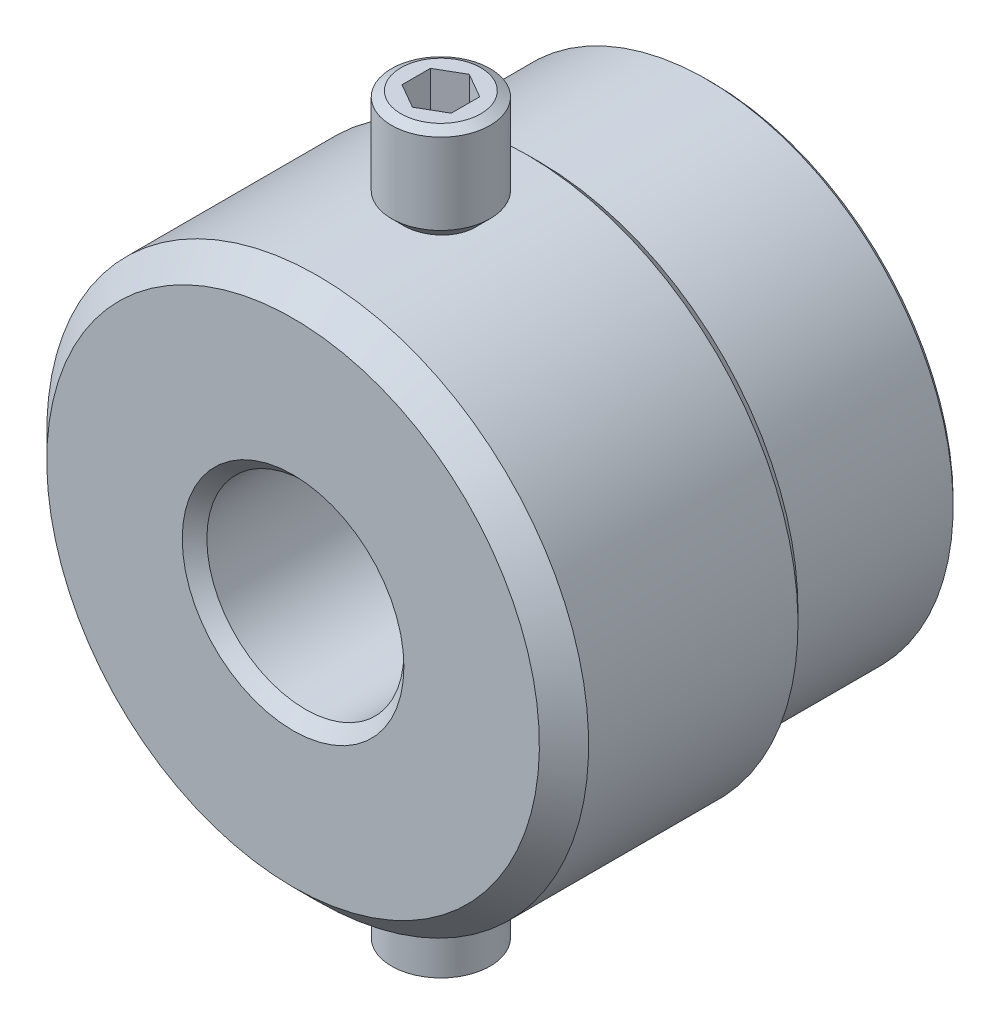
ISO-10303-21;
HEADER;
FILE_DESCRIPTION(('STEP AP214'),'2;1');
FILE_NAME('part.step','',(''),(''),'','','');
FILE_SCHEMA(('AUTOMOTIVE_DESIGN { 1 0 10303 214 1 1 1 1 }'));
ENDSEC;
DATA;
#1=APPLICATION_CONTEXT('core data for automotive mechanical design processes');
#2=APPLICATION_PROTOCOL_DEFINITION('international standard','automotive_design',2000,#1);
#3=PRODUCT_CONTEXT('',#1,'mechanical');
#4=PRODUCT('Part','Part','',(#3));
#5=PRODUCT_RELATED_PRODUCT_CATEGORY('part','',(#4));
#6=PRODUCT_DEFINITION_FORMATION('','',#4);
#7=PRODUCT_DEFINITION_CONTEXT('part definition',#1,'design');
#8=PRODUCT_DEFINITION('design','',#6,#7);
#9=PRODUCT_DEFINITION_SHAPE('','',#8);
#10=(LENGTH_UNIT() NAMED_UNIT(*) SI_UNIT(.MILLI.,.METRE.));
#11=(NAMED_UNIT(*) PLANE_ANGLE_UNIT() SI_UNIT($,.RADIAN.));
#12=(NAMED_UNIT(*) SI_UNIT($,.STERADIAN.) SOLID_ANGLE_UNIT());
#13=UNCERTAINTY_MEASURE_WITH_UNIT(LENGTH_MEASURE(1.E-05),#10,'distance_accuracy_value','');
#14=(GEOMETRIC_REPRESENTATION_CONTEXT(3) GLOBAL_UNCERTAINTY_ASSIGNED_CONTEXT((#13)) GLOBAL_UNIT_ASSIGNED_CONTEXT((#10,
#11,#12)) REPRESENTATION_CONTEXT('',''));
#15=CARTESIAN_POINT('',(0.,0.,0.));
#16=DIRECTION('',(0.,0.,1.));
#17=DIRECTION('',(1.,0.,0.));
#18=AXIS2_PLACEMENT_3D('',#15,#16,#17);
#19=CARTESIAN_POINT('',(0.,0.,-10.));
#20=DIRECTION('',(0.,0.,-1.));
#21=DIRECTION('',(0.,1.,0.));
#22=AXIS2_PLACEMENT_3D('',#19,#20,#21);
#23=CYLINDRICAL_SURFACE('',#22,4.);
#24=CARTESIAN_POINT('',(0.,0.,-19.));
#25=DIRECTION('',(0.,0.,-1.));
#26=DIRECTION('',(0.,1.,0.));
#27=AXIS2_PLACEMENT_3D('',#24,#25,#26);
#28=CIRCLE('',#27,4.);
#29=CARTESIAN_POINT('',(0.,3.99999999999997,-19.));
#30=VERTEX_POINT('',#29);
#31=EDGE_CURVE('E1013',#30,#30,#28,.T.);
#32=ORIENTED_EDGE('',*,*,#31,.T.);
#33=EDGE_LOOP('',(#32));
#34=FACE_BOUND('',#33,.T.);
#35=CARTESIAN_POINT('',(0.,0.,-0.499999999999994));
#36=DIRECTION('',(0.,0.,1.));
#37=DIRECTION('',(0.,-1.,0.));
#38=AXIS2_PLACEMENT_3D('',#35,#36,#37);
#39=CIRCLE('',#38,4.);
#40=CARTESIAN_POINT('',(0.,-4.00000000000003,-0.499999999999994));
#41=VERTEX_POINT('',#40);
#42=EDGE_CURVE('E1029',#41,#41,#39,.T.);
#43=ORIENTED_EDGE('',*,*,#42,.T.);
#44=EDGE_LOOP('',(#43));
#45=FACE_BOUND('',#44,.T.);
#46=CARTESIAN_POINT('',(-3.7777777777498,1.3146843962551,-13.));
#47=CARTESIAN_POINT('',(-3.77777855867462,1.31468371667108,-13.0823370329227));
#48=CARTESIAN_POINT('',(-3.78005912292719,1.30818348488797,-13.1646828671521));
#49=CARTESIAN_POINT('',(-3.78893194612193,1.28225551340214,-13.3270886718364));
#50=CARTESIAN_POINT('',(-3.79552491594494,1.26282564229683,-13.407148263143));
#51=CARTESIAN_POINT('',(-3.8122922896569,1.21126355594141,-13.5627536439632));
#52=CARTESIAN_POINT('',(-3.82246954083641,1.17912123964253,-13.6382957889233));
#53=CARTESIAN_POINT('',(-3.84523820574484,1.10260133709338,-13.7825277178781));
#54=CARTESIAN_POINT('',(-3.85782950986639,1.05822430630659,-13.8512178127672));
#55=CARTESIAN_POINT('',(-3.88366916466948,0.959001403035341,-13.9782568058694));
#56=CARTESIAN_POINT('',(-3.89690001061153,0.904375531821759,-14.03678059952));
#57=CARTESIAN_POINT('',(-3.9226275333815,0.785295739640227,-14.1430120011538));
#58=CARTESIAN_POINT('',(-3.93512448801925,0.720845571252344,-14.1907237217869));
#59=CARTESIAN_POINT('',(-3.95706527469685,0.588108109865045,-14.2708654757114));
#60=CARTESIAN_POINT('',(-3.96665029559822,0.520305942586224,-14.3040591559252));
#61=CARTESIAN_POINT('',(-3.98258050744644,0.379543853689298,-14.3579240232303));
#62=CARTESIAN_POINT('',(-3.98892747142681,0.30658677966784,-14.3786020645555));
#63=CARTESIAN_POINT('',(-3.99725442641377,0.163443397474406,-14.4055091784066));
#64=CARTESIAN_POINT('',(-3.99952338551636,0.0934528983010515,-14.4126961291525));
#65=CARTESIAN_POINT('',(-4.00034035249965,-0.0467605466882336,-14.4152973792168));
#66=CARTESIAN_POINT('',(-3.99888929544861,-0.116983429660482,-14.4107146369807));
#67=CARTESIAN_POINT('',(-3.99255091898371,-0.253001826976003,-14.3903430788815));
#68=CARTESIAN_POINT('',(-3.98778978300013,-0.318865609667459,-14.3749655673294));
#69=CARTESIAN_POINT('',(-3.97546153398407,-0.447051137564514,-14.3340054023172));
#70=CARTESIAN_POINT('',(-3.96789426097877,-0.509372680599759,-14.3084221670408));
#71=CARTESIAN_POINT('',(-3.95050064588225,-0.630374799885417,-14.2471812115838));
#72=CARTESIAN_POINT('',(-3.94062529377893,-0.68893504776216,-14.2113003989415));
#73=CARTESIAN_POINT('',(-3.91969023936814,-0.799500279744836,-14.130852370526));
#74=CARTESIAN_POINT('',(-3.90863023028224,-0.851503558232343,-14.0862829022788));
#75=CARTESIAN_POINT('',(-3.88562640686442,-0.951154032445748,-13.9865481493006));
#76=CARTESIAN_POINT('',(-3.8736719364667,-0.998297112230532,-13.9308819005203));
#77=CARTESIAN_POINT('',(-3.8507713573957,-1.08328301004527,-13.8126717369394));
#78=CARTESIAN_POINT('',(-3.8398255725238,-1.12112284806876,-13.7501256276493));
#79=CARTESIAN_POINT('',(-3.8192983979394,-1.18925080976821,-13.6152499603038));
#80=CARTESIAN_POINT('',(-3.80986338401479,-1.21883717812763,-13.5425430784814));
#81=CARTESIAN_POINT('',(-3.79432528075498,-1.26638207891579,-13.3930828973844));
#82=CARTESIAN_POINT('',(-3.78822295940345,-1.28433793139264,-13.3163286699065));
#83=CARTESIAN_POINT('',(-3.77980537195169,-1.30891251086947,-13.1575067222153));
#84=CARTESIAN_POINT('',(-3.77765959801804,-1.31502438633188,-13.0753511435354));
#85=CARTESIAN_POINT('',(-3.77790615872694,-1.31431509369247,-12.9110979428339));
#86=CARTESIAN_POINT('',(-3.78029901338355,-1.30749244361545,-12.8290003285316));
#87=CARTESIAN_POINT('',(-3.7894148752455,-1.28083358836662,-12.6661720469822));
#88=CARTESIAN_POINT('',(-3.79618933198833,-1.26084270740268,-12.5854694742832));
#89=CARTESIAN_POINT('',(-3.81334732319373,-1.20795292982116,-12.4288024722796));
#90=CARTESIAN_POINT('',(-3.82373097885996,-1.17505359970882,-12.3528382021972));
#91=CARTESIAN_POINT('',(-3.84676448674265,-1.09727992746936,-12.2087881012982));
#92=CARTESIAN_POINT('',(-3.85938767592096,-1.05254372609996,-12.1406236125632));
#93=CARTESIAN_POINT('',(-3.88547414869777,-0.951730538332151,-12.0134314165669));
#94=CARTESIAN_POINT('',(-3.89893725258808,-0.895655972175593,-11.9544017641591));
#95=CARTESIAN_POINT('',(-3.92442745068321,-0.776161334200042,-11.8500186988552));
#96=CARTESIAN_POINT('',(-3.93649181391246,-0.713180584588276,-11.8041726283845));
#97=CARTESIAN_POINT('',(-3.95835446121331,-0.579646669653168,-11.7245457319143));
#98=CARTESIAN_POINT('',(-3.96815397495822,-0.50909764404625,-11.6907583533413));
#99=CARTESIAN_POINT('',(-3.98361280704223,-0.368076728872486,-11.6386975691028));
#100=CARTESIAN_POINT('',(-3.98952585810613,-0.297989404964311,-11.6194571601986));
#101=CARTESIAN_POINT('',(-3.99761923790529,-0.155346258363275,-11.5933198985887));
#102=CARTESIAN_POINT('',(-3.99980112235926,-0.0827914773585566,-11.5864179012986));
#103=CARTESIAN_POINT('',(-4.00016181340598,0.0580744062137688,-11.5852728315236));
#104=CARTESIAN_POINT('',(-3.99857187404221,0.126380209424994,-11.5902984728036));
#105=CARTESIAN_POINT('',(-3.99203834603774,0.261109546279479,-11.6113119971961));
#106=CARTESIAN_POINT('',(-3.98709501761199,0.327533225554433,-11.627299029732));
#107=CARTESIAN_POINT('',(-3.97440569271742,0.45637141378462,-11.6695522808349));
#108=CARTESIAN_POINT('',(-3.96667311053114,0.518803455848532,-11.6957693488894));
#109=CARTESIAN_POINT('',(-3.949175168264,0.638497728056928,-11.7576115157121));
#110=CARTESIAN_POINT('',(-3.9394094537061,0.695759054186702,-11.7932382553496));
#111=CARTESIAN_POINT('',(-3.91825979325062,0.806586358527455,-11.8747990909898));
#112=CARTESIAN_POINT('',(-3.90681978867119,0.859830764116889,-11.9211549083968));
#113=CARTESIAN_POINT('',(-3.88384063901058,0.958302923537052,-12.0216898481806));
#114=CARTESIAN_POINT('',(-3.87230146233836,1.00352801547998,-12.0758715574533));
#115=CARTESIAN_POINT('',(-3.84939995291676,1.08820267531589,-12.1947812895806));
#116=CARTESIAN_POINT('',(-3.83811051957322,1.12699963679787,-12.2599882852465));
#117=CARTESIAN_POINT('',(-3.81780449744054,1.19398404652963,-12.3959617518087));
#118=CARTESIAN_POINT('',(-3.80878833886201,1.22216948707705,-12.4667292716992));
#119=CARTESIAN_POINT('',(-3.79376252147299,1.26805556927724,-12.6135329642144));
#120=CARTESIAN_POINT('',(-3.7878196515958,1.28552471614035,-12.6896483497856));
#121=CARTESIAN_POINT('',(-3.77982664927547,1.30884022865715,-12.8438396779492));
#122=CARTESIAN_POINT('',(-3.77777703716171,1.31468504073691,-12.9219158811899));
#123=CARTESIAN_POINT('',(-3.7777777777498,1.3146843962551,-13.));
#124=B_SPLINE_CURVE_WITH_KNOTS('',3,(#46,#47,#48,#49,#50,#51,#52,#53,#54,#55,#56,#57,#58,#59,
#60,#61,#62,#63,#64,#65,#66,#67,#68,#69,#70,#71,#72,#73,#74,#75,#76,#77,#78,#79,#80,#81,#82,#83,
#84,#85,#86,#87,#88,#89,#90,#91,#92,#93,#94,#95,#96,#97,#98,#99,#100,#101,#102,#103,#104,#105,
#106,#107,#108,#109,#110,#111,#112,#113,#114,#115,#116,#117,#118,#119,#120,#121,#122,#123),
.UNSPECIFIED.,.T.,.F.,(4,2,2,2,2,2,2,2,2,2,2,2,2,2,2,2,2,2,2,2,2,2,2,2,2,2,2,2,2,2,2,2,2,2,2,2,
2,2,4),(0.,0.246739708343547,0.493520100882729,0.74049697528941,0.987462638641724,
1.2296330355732,1.47171116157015,1.69879113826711,1.92574664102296,2.13586981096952,
2.34594016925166,2.54841255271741,2.75089648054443,2.95814951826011,3.16545635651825,
3.38626156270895,3.60713740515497,3.84326287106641,4.07944272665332,4.32552408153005,
4.57163363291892,4.82068683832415,5.06974840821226,5.3160225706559,5.56224421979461,
5.79748096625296,6.03258969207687,6.25021106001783,6.4677416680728,6.67228298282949,
6.87680842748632,7.08036308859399,7.283953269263,7.49758521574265,7.7112879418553,
7.94041761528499,8.16959061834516,8.40355433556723,8.63754931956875),.UNSPECIFIED.);
#125=CARTESIAN_POINT('',(-3.7777777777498,1.3146843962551,-13.));
#126=VERTEX_POINT('',#125);
#127=EDGE_CURVE('E295',#126,#126,#124,.T.);
#128=ORIENTED_EDGE('',*,*,#127,.T.);
#129=EDGE_LOOP('',(#128));
#130=FACE_BOUND('',#129,.T.);
#131=CARTESIAN_POINT('',(3.7777777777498,1.3146843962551,-13.));
#132=CARTESIAN_POINT('',(3.77777855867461,1.31468371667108,-13.0823370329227));
#133=CARTESIAN_POINT('',(3.78005912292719,1.30818348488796,-13.1646828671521));
#134=CARTESIAN_POINT('',(3.78893194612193,1.28225551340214,-13.3270886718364));
#135=CARTESIAN_POINT('',(3.79552491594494,1.26282564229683,-13.407148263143));
#136=CARTESIAN_POINT('',(3.8122922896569,1.21126355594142,-13.5627536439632));
#137=CARTESIAN_POINT('',(3.82246954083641,1.17912123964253,-13.6382957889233));
#138=CARTESIAN_POINT('',(3.84523820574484,1.10260133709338,-13.7825277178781));
#139=CARTESIAN_POINT('',(3.85782950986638,1.05822430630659,-13.8512178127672));
#140=CARTESIAN_POINT('',(3.88366916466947,0.959001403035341,-13.9782568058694));
#141=CARTESIAN_POINT('',(3.89690001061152,0.904375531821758,-14.03678059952));
#142=CARTESIAN_POINT('',(3.92262753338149,0.785295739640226,-14.1430120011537));
#143=CARTESIAN_POINT('',(3.93512448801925,0.720845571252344,-14.1907237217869));
#144=CARTESIAN_POINT('',(3.95706527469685,0.588108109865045,-14.2708654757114));
#145=CARTESIAN_POINT('',(3.96665029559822,0.520305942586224,-14.3040591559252));
#146=CARTESIAN_POINT('',(3.98258050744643,0.379543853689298,-14.3579240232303));
#147=CARTESIAN_POINT('',(3.98892747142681,0.306586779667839,-14.3786020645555));
#148=CARTESIAN_POINT('',(3.99725442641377,0.163443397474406,-14.4055091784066));
#149=CARTESIAN_POINT('',(3.99952338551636,0.0934528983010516,-14.4126961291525));
#150=CARTESIAN_POINT('',(4.00034035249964,-0.0467605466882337,-14.4152973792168));
#151=CARTESIAN_POINT('',(3.99888929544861,-0.116983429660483,-14.4107146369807));
#152=CARTESIAN_POINT('',(3.99255091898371,-0.253001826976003,-14.3903430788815));
#153=CARTESIAN_POINT('',(3.98778978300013,-0.318865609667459,-14.3749655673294));
#154=CARTESIAN_POINT('',(3.97546153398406,-0.447051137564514,-14.3340054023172));
#155=CARTESIAN_POINT('',(3.96789426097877,-0.509372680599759,-14.3084221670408));
#156=CARTESIAN_POINT('',(3.95050064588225,-0.630374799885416,-14.2471812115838));
#157=CARTESIAN_POINT('',(3.94062529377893,-0.688935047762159,-14.2113003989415));
#158=CARTESIAN_POINT('',(3.91969023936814,-0.799500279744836,-14.130852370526));
#159=CARTESIAN_POINT('',(3.90863023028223,-0.851503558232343,-14.0862829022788));
#160=CARTESIAN_POINT('',(3.88562640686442,-0.951154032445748,-13.9865481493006));
#161=CARTESIAN_POINT('',(3.8736719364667,-0.998297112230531,-13.9308819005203));
#162=CARTESIAN_POINT('',(3.8507713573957,-1.08328301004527,-13.8126717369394));
#163=CARTESIAN_POINT('',(3.83982557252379,-1.12112284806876,-13.7501256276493));
#164=CARTESIAN_POINT('',(3.8192983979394,-1.18925080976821,-13.6152499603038));
#165=CARTESIAN_POINT('',(3.80986338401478,-1.21883717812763,-13.5425430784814));
#166=CARTESIAN_POINT('',(3.79432528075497,-1.26638207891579,-13.3930828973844));
#167=CARTESIAN_POINT('',(3.78822295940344,-1.28433793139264,-13.3163286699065));
#168=CARTESIAN_POINT('',(3.77980537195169,-1.30891251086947,-13.1575067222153));
#169=CARTESIAN_POINT('',(3.77765959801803,-1.31502438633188,-13.0753511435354));
#170=CARTESIAN_POINT('',(3.77790615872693,-1.31431509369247,-12.9110979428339));
#171=CARTESIAN_POINT('',(3.78029901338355,-1.30749244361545,-12.8290003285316));
#172=CARTESIAN_POINT('',(3.7894148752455,-1.28083358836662,-12.6661720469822));
#173=CARTESIAN_POINT('',(3.79618933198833,-1.26084270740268,-12.5854694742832));
#174=CARTESIAN_POINT('',(3.81334732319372,-1.20795292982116,-12.4288024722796));
#175=CARTESIAN_POINT('',(3.82373097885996,-1.17505359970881,-12.3528382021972));
#176=CARTESIAN_POINT('',(3.84676448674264,-1.09727992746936,-12.2087881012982));
#177=CARTESIAN_POINT('',(3.85938767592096,-1.05254372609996,-12.1406236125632));
#178=CARTESIAN_POINT('',(3.88547414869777,-0.95173053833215,-12.0134314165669));
#179=CARTESIAN_POINT('',(3.89893725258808,-0.895655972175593,-11.9544017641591));
#180=CARTESIAN_POINT('',(3.9244274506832,-0.776161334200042,-11.8500186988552));
#181=CARTESIAN_POINT('',(3.93649181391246,-0.713180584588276,-11.8041726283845));
#182=CARTESIAN_POINT('',(3.95835446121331,-0.579646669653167,-11.7245457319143));
#183=CARTESIAN_POINT('',(3.96815397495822,-0.50909764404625,-11.6907583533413));
#184=CARTESIAN_POINT('',(3.98361280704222,-0.368076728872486,-11.6386975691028));
#185=CARTESIAN_POINT('',(3.98952585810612,-0.297989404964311,-11.6194571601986));
#186=CARTESIAN_POINT('',(3.99761923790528,-0.155346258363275,-11.5933198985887));
#187=CARTESIAN_POINT('',(3.99980112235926,-0.0827914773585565,-11.5864179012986));
#188=CARTESIAN_POINT('',(4.00016181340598,0.0580744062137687,-11.5852728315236));
#189=CARTESIAN_POINT('',(3.99857187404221,0.126380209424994,-11.5902984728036));
#190=CARTESIAN_POINT('',(3.99203834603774,0.261109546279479,-11.6113119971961));
#191=CARTESIAN_POINT('',(3.98709501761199,0.327533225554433,-11.627299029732));
#192=CARTESIAN_POINT('',(3.97440569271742,0.45637141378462,-11.6695522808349));
#193=CARTESIAN_POINT('',(3.96667311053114,0.518803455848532,-11.6957693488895));
#194=CARTESIAN_POINT('',(3.949175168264,0.638497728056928,-11.7576115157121));
#195=CARTESIAN_POINT('',(3.9394094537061,0.695759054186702,-11.7932382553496));
#196=CARTESIAN_POINT('',(3.91825979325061,0.806586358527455,-11.8747990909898));
#197=CARTESIAN_POINT('',(3.90681978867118,0.859830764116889,-11.9211549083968));
#198=CARTESIAN_POINT('',(3.88384063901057,0.958302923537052,-12.0216898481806));
#199=CARTESIAN_POINT('',(3.87230146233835,1.00352801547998,-12.0758715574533));
#200=CARTESIAN_POINT('',(3.84939995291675,1.08820267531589,-12.1947812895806));
#201=CARTESIAN_POINT('',(3.83811051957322,1.12699963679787,-12.2599882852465));
#202=CARTESIAN_POINT('',(3.81780449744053,1.19398404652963,-12.3959617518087));
#203=CARTESIAN_POINT('',(3.80878833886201,1.22216948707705,-12.4667292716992));
#204=CARTESIAN_POINT('',(3.79376252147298,1.26805556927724,-12.6135329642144));
#205=CARTESIAN_POINT('',(3.78781965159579,1.28552471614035,-12.6896483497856));
#206=CARTESIAN_POINT('',(3.77982664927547,1.30884022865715,-12.8438396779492));
#207=CARTESIAN_POINT('',(3.7777770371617,1.31468504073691,-12.9219158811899));
#208=CARTESIAN_POINT('',(3.7777777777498,1.3146843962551,-13.));
#209=B_SPLINE_CURVE_WITH_KNOTS('',3,(#131,#132,#133,#134,#135,#136,#137,#138,#139,#140,#141,
#142,#143,#144,#145,#146,#147,#148,#149,#150,#151,#152,#153,#154,#155,#156,#157,#158,#159,#160,
#161,#162,#163,#164,#165,#166,#167,#168,#169,#170,#171,#172,#173,#174,#175,#176,#177,#178,#179,
#180,#181,#182,#183,#184,#185,#186,#187,#188,#189,#190,#191,#192,#193,#194,#195,#196,#197,#198,
#199,#200,#201,#202,#203,#204,#205,#206,#207,#208),.UNSPECIFIED.,.T.,.F.,(4,2,2,2,2,2,2,2,2,2,2,
2,2,2,2,2,2,2,2,2,2,2,2,2,2,2,2,2,2,2,2,2,2,2,2,2,2,2,4),(0.,0.246739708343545,
0.493520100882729,0.740496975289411,0.987462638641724,1.2296330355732,1.47171116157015,
1.69879113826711,1.92574664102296,2.13586981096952,2.34594016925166,2.54841255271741,
2.75089648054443,2.9581495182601,3.16545635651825,3.38626156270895,3.60713740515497,
3.84326287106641,4.07944272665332,4.32552408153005,4.57163363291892,4.82068683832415,
5.06974840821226,5.31602257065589,5.56224421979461,5.79748096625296,6.03258969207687,
6.25021106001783,6.4677416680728,6.67228298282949,6.87680842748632,7.08036308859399,
7.28395326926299,7.49758521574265,7.7112879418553,7.94041761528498,8.16959061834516,
8.40355433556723,8.63754931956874),.UNSPECIFIED.);
#210=CARTESIAN_POINT('',(3.7777777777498,1.3146843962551,-13.));
#211=VERTEX_POINT('',#210);
#212=EDGE_CURVE('E9',#211,#211,#209,.T.);
#213=ORIENTED_EDGE('',*,*,#212,.F.);
#214=EDGE_LOOP('',(#213));
#215=FACE_BOUND('',#214,.T.);
#216=ADVANCED_FACE('F15',(#34,#45,#130,#215),#23,.F.);
#217=CARTESIAN_POINT('',(0.,0.,-17.));
#218=DIRECTION('',(0.,0.,1.));
#219=DIRECTION('',(1.,0.,0.));
#220=AXIS2_PLACEMENT_3D('',#217,#218,#219);
#221=CONICAL_SURFACE('',#220,9.8,0.785398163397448);
#222=CARTESIAN_POINT('',(0.,0.,-16.8));
#223=DIRECTION('',(0.,0.,-1.));
#224=DIRECTION('',(-1.,0.,0.));
#225=AXIS2_PLACEMENT_3D('',#222,#223,#224);
#226=CIRCLE('',#225,10.);
#227=CARTESIAN_POINT('',(-10.,0.,-16.8));
#228=VERTEX_POINT('',#227);
#229=EDGE_CURVE('E301',#228,#228,#226,.F.);
#230=ORIENTED_EDGE('',*,*,#229,.F.);
#231=EDGE_LOOP('',(#230));
#232=FACE_BOUND('',#231,.T.);
#233=CARTESIAN_POINT('',(0.,0.,-17.));
#234=DIRECTION('',(0.,0.,-1.));
#235=DIRECTION('',(-1.,0.,0.));
#236=AXIS2_PLACEMENT_3D('',#233,#234,#235);
#237=CIRCLE('',#236,9.8);
#238=CARTESIAN_POINT('',(-9.8,0.,-17.));
#239=VERTEX_POINT('',#238);
#240=EDGE_CURVE('E26',#239,#239,#237,.T.);
#241=ORIENTED_EDGE('',*,*,#240,.F.);
#242=EDGE_LOOP('',(#241));
#243=FACE_BOUND('',#242,.T.);
#244=ADVANCED_FACE('F256',(#232,#243),#221,.T.);
#245=CARTESIAN_POINT('',(0.,0.,-17.));
#246=DIRECTION('',(0.,0.,-1.));
#247=DIRECTION('',(-1.,0.,0.));
#248=AXIS2_PLACEMENT_3D('',#245,#246,#247);
#249=PLANE('',#248);
#250=ORIENTED_EDGE('',*,*,#240,.T.);
#251=EDGE_LOOP('',(#250));
#252=FACE_BOUND('',#251,.T.);
#253=CARTESIAN_POINT('',(0.,0.,-17.));
#254=DIRECTION('',(0.,0.,-1.));
#255=DIRECTION('',(0.,1.,0.));
#256=AXIS2_PLACEMENT_3D('',#253,#254,#255);
#257=CIRCLE('',#256,5.39999999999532);
#258=CARTESIAN_POINT('',(5.37556539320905,0.513124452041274,-17.));
#259=VERTEX_POINT('',#258);
#260=CARTESIAN_POINT('',(5.37556539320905,-0.513124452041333,-17.));
#261=VERTEX_POINT('',#260);
#262=EDGE_CURVE('E1032',#259,#261,#257,.T.);
#263=ORIENTED_EDGE('',*,*,#262,.F.);
#264=DIRECTION('',(0.965925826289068,0.258819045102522,0.));
#265=VECTOR('',#264,1.);
#266=CARTESIAN_POINT('',(5.32658427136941,0.49999999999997,-17.));
#267=LINE('',#266,#265);
#268=CARTESIAN_POINT('',(5.76698110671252,0.618003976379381,-17.));
#269=VERTEX_POINT('',#268);
#270=EDGE_CURVE('E194',#259,#269,#267,.T.);
#271=ORIENTED_EDGE('',*,*,#270,.T.);
#272=CARTESIAN_POINT('',(0.,0.,-17.));
#273=DIRECTION('',(0.,0.,-1.));
#274=DIRECTION('',(1.,0.,0.));
#275=AXIS2_PLACEMENT_3D('',#272,#273,#274);
#276=CIRCLE('',#275,5.8);
#277=CARTESIAN_POINT('',(5.76698110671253,-0.618003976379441,-17.));
#278=VERTEX_POINT('',#277);
#279=EDGE_CURVE('E193',#278,#269,#276,.T.);
#280=ORIENTED_EDGE('',*,*,#279,.F.);
#281=DIRECTION('',(-0.965925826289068,0.258819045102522,0.));
#282=VECTOR('',#281,1.);
#283=CARTESIAN_POINT('',(-1.26818651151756,1.2670635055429,-17.));
#284=LINE('',#283,#282);
#285=EDGE_CURVE('E174',#278,#261,#284,.T.);
#286=ORIENTED_EDGE('',*,*,#285,.T.);
#287=EDGE_LOOP('',(#263,#271,#280,#286));
#288=FACE_BOUND('',#287,.T.);
#289=ADVANCED_FACE('F263',(#252,#288),#249,.T.);
#290=CARTESIAN_POINT('',(0.,0.,-17.));
#291=DIRECTION('',(0.,0.,1.));
#292=DIRECTION('',(1.,0.,0.));
#293=AXIS2_PLACEMENT_3D('',#290,#291,#292);
#294=CYLINDRICAL_SURFACE('',#293,10.);
#295=CARTESIAN_POINT('',(0.,0.,-10.2));
#296=DIRECTION('',(0.,0.,-1.));
#297=DIRECTION('',(-1.,0.,0.));
#298=AXIS2_PLACEMENT_3D('',#295,#296,#297);
#299=CIRCLE('',#298,10.);
#300=CARTESIAN_POINT('',(-10.,0.,-10.2));
#301=VERTEX_POINT('',#300);
#302=EDGE_CURVE('E1088',#301,#301,#299,.T.);
#303=ORIENTED_EDGE('',*,*,#302,.T.);
#304=EDGE_LOOP('',(#303));
#305=FACE_BOUND('',#304,.T.);
#306=ORIENTED_EDGE('',*,*,#229,.T.);
#307=EDGE_LOOP('',(#306));
#308=FACE_BOUND('',#307,.T.);
#309=ADVANCED_FACE('F973',(#305,#308),#294,.T.);
#310=CARTESIAN_POINT('',(0.,0.,-10.2));
#311=DIRECTION('',(0.,0.,-1.));
#312=DIRECTION('',(-1.,0.,0.));
#313=AXIS2_PLACEMENT_3D('',#310,#311,#312);
#314=CONICAL_SURFACE('',#313,10.,0.785398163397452);
#315=CARTESIAN_POINT('',(0.,0.,-10.));
#316=DIRECTION('',(0.,0.,-1.));
#317=DIRECTION('',(-1.,0.,0.));
#318=AXIS2_PLACEMENT_3D('',#315,#316,#317);
#319=CIRCLE('',#318,9.8);
#320=CARTESIAN_POINT('',(-9.8,0.,-10.));
#321=VERTEX_POINT('',#320);
#322=EDGE_CURVE('E1085',#321,#321,#319,.F.);
#323=ORIENTED_EDGE('',*,*,#322,.F.);
#324=EDGE_LOOP('',(#323));
#325=FACE_BOUND('',#324,.T.);
#326=ORIENTED_EDGE('',*,*,#302,.F.);
#327=EDGE_LOOP('',(#326));
#328=FACE_BOUND('',#327,.T.);
#329=ADVANCED_FACE('F498',(#325,#328),#314,.T.);
#330=CARTESIAN_POINT('',(0.,13.5,-6.));
#331=DIRECTION('',(0.,1.,0.));
#332=DIRECTION('',(1.,0.,0.));
#333=AXIS2_PLACEMENT_3D('',#330,#331,#332);
#334=CONICAL_SURFACE('',#333,1.,1.02974425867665);
#335=CARTESIAN_POINT('',(0.,12.8991393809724,-6.));
#336=VERTEX_POINT('',#335);
#337=VERTEX_LOOP('',#336);
#338=FACE_BOUND('',#337,.T.);
#339=CARTESIAN_POINT('',(0.,13.5,-6.));
#340=DIRECTION('',(0.,1.,0.));
#341=DIRECTION('',(1.,0.,0.));
#342=AXIS2_PLACEMENT_3D('',#339,#340,#341);
#343=CIRCLE('',#342,1.);
#344=CARTESIAN_POINT('',(1.,13.5,-6.));
#345=VERTEX_POINT('',#344);
#346=CARTESIAN_POINT('',(0.5,13.5,-6.86602540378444));
#347=VERTEX_POINT('',#346);
#348=EDGE_CURVE('E433',#345,#347,#343,.T.);
#349=ORIENTED_EDGE('',*,*,#348,.T.);
#350=CARTESIAN_POINT('',(-0.5,13.5,-6.86602540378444));
#351=VERTEX_POINT('',#350);
#352=EDGE_CURVE('E437',#347,#351,#343,.T.);
#353=ORIENTED_EDGE('',*,*,#352,.T.);
#354=CARTESIAN_POINT('',(-1.,13.5,-6.));
#355=VERTEX_POINT('',#354);
#356=EDGE_CURVE('E562',#351,#355,#343,.T.);
#357=ORIENTED_EDGE('',*,*,#356,.T.);
#358=CARTESIAN_POINT('',(-0.5,13.5,-5.13397459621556));
#359=VERTEX_POINT('',#358);
#360=EDGE_CURVE('E567',#355,#359,#343,.T.);
#361=ORIENTED_EDGE('',*,*,#360,.T.);
#362=CARTESIAN_POINT('',(0.5,13.5,-5.13397459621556));
#363=VERTEX_POINT('',#362);
#364=EDGE_CURVE('E569',#359,#363,#343,.T.);
#365=ORIENTED_EDGE('',*,*,#364,.T.);
#366=EDGE_CURVE('E418',#363,#345,#343,.T.);
#367=ORIENTED_EDGE('',*,*,#366,.T.);
#368=EDGE_LOOP('',(#349,#353,#357,#361,#365,#367));
#369=FACE_BOUND('',#368,.T.);
#370=ADVANCED_FACE('F285',(#338,#369),#334,.F.);
#371=CARTESIAN_POINT('',(0.,-13.5,-6.));
#372=DIRECTION('',(0.,-1.,0.));
#373=DIRECTION('',(-1.,0.,0.));
#374=AXIS2_PLACEMENT_3D('',#371,#372,#373);
#375=CONICAL_SURFACE('',#374,1.,1.02974425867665);
#376=CARTESIAN_POINT('',(0.,-12.8991393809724,-6.));
#377=VERTEX_POINT('',#376);
#378=VERTEX_LOOP('',#377);
#379=FACE_BOUND('',#378,.T.);
#380=CARTESIAN_POINT('',(0.,-13.5,-6.));
#381=DIRECTION('',(0.,-1.,0.));
#382=DIRECTION('',(-1.,0.,0.));
#383=AXIS2_PLACEMENT_3D('',#380,#381,#382);
#384=CIRCLE('',#383,1.);
#385=CARTESIAN_POINT('',(-1.,-13.5,-6.));
#386=VERTEX_POINT('',#385);
#387=CARTESIAN_POINT('',(-0.5,-13.5,-6.86602540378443));
#388=VERTEX_POINT('',#387);
#389=EDGE_CURVE('E362',#386,#388,#384,.T.);
#390=ORIENTED_EDGE('',*,*,#389,.T.);
#391=CARTESIAN_POINT('',(0.5,-13.5,-6.86602540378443));
#392=VERTEX_POINT('',#391);
#393=EDGE_CURVE('E366',#388,#392,#384,.T.);
#394=ORIENTED_EDGE('',*,*,#393,.T.);
#395=CARTESIAN_POINT('',(1.,-13.5,-6.));
#396=VERTEX_POINT('',#395);
#397=EDGE_CURVE('E657',#392,#396,#384,.T.);
#398=ORIENTED_EDGE('',*,*,#397,.T.);
#399=CARTESIAN_POINT('',(0.5,-13.5,-5.13397459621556));
#400=VERTEX_POINT('',#399);
#401=EDGE_CURVE('E656',#396,#400,#384,.T.);
#402=ORIENTED_EDGE('',*,*,#401,.T.);
#403=CARTESIAN_POINT('',(-0.5,-13.5,-5.13397459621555));
#404=VERTEX_POINT('',#403);
#405=EDGE_CURVE('E655',#400,#404,#384,.T.);
#406=ORIENTED_EDGE('',*,*,#405,.T.);
#407=EDGE_CURVE('E347',#404,#386,#384,.T.);
#408=ORIENTED_EDGE('',*,*,#407,.T.);
#409=EDGE_LOOP('',(#390,#394,#398,#402,#406,#408));
#410=FACE_BOUND('',#409,.T.);
#411=ADVANCED_FACE('F266',(#379,#410),#375,.F.);
#412=CARTESIAN_POINT('',(0.,13.5,-6.));
#413=DIRECTION('',(0.,1.,0.));
#414=DIRECTION('',(1.,0.,0.));
#415=AXIS2_PLACEMENT_3D('',#412,#413,#414);
#416=PLANE('',#415);
#417=ORIENTED_EDGE('',*,*,#356,.F.);
#418=DIRECTION('',(-0.866025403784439,0.,0.5));
#419=VECTOR('',#418,1.);
#420=CARTESIAN_POINT('',(0.,13.5,-7.15470053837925));
#421=LINE('',#420,#419);
#422=CARTESIAN_POINT('',(-1.,13.5,-6.57735026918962));
#423=VERTEX_POINT('',#422);
#424=EDGE_CURVE('E383',#351,#423,#421,.T.);
#425=ORIENTED_EDGE('',*,*,#424,.T.);
#426=DIRECTION('',(0.,0.,1.));
#427=VECTOR('',#426,1.);
#428=CARTESIAN_POINT('',(-1.,13.5,-6.57735026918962));
#429=LINE('',#428,#427);
#430=EDGE_CURVE('E388',#423,#355,#429,.T.);
#431=ORIENTED_EDGE('',*,*,#430,.T.);
#432=EDGE_LOOP('',(#417,#425,#431));
#433=FACE_BOUND('',#432,.T.);
#434=ADVANCED_FACE('F561',(#433),#416,.T.);
#435=ORIENTED_EDGE('',*,*,#360,.F.);
#436=CARTESIAN_POINT('',(-1.,13.5,-5.42264973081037));
#437=VERTEX_POINT('',#436);
#438=EDGE_CURVE('E387',#355,#437,#429,.T.);
#439=ORIENTED_EDGE('',*,*,#438,.T.);
#440=DIRECTION('',(0.866025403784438,0.,0.5));
#441=VECTOR('',#440,1.);
#442=CARTESIAN_POINT('',(-1.,13.5,-5.42264973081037));
#443=LINE('',#442,#441);
#444=EDGE_CURVE('E392',#437,#359,#443,.T.);
#445=ORIENTED_EDGE('',*,*,#444,.T.);
#446=EDGE_LOOP('',(#435,#439,#445));
#447=FACE_BOUND('',#446,.T.);
#448=ADVANCED_FACE('F596',(#447),#416,.T.);
#449=ORIENTED_EDGE('',*,*,#364,.F.);
#450=CARTESIAN_POINT('',(0.,13.5,-4.84529946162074));
#451=VERTEX_POINT('',#450);
#452=EDGE_CURVE('E391',#359,#451,#443,.T.);
#453=ORIENTED_EDGE('',*,*,#452,.T.);
#454=DIRECTION('',(0.866025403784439,0.,-0.5));
#455=VECTOR('',#454,1.);
#456=CARTESIAN_POINT('',(0.,13.5,-4.84529946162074));
#457=LINE('',#456,#455);
#458=EDGE_CURVE('E396',#451,#363,#457,.T.);
#459=ORIENTED_EDGE('',*,*,#458,.T.);
#460=EDGE_LOOP('',(#449,#453,#459));
#461=FACE_BOUND('',#460,.T.);
#462=ADVANCED_FACE('F535',(#461),#416,.T.);
#463=ORIENTED_EDGE('',*,*,#366,.F.);
#464=CARTESIAN_POINT('',(1.,13.5,-5.42264973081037));
#465=VERTEX_POINT('',#464);
#466=EDGE_CURVE('E395',#363,#465,#457,.T.);
#467=ORIENTED_EDGE('',*,*,#466,.T.);
#468=DIRECTION('',(0.,0.,-1.));
#469=VECTOR('',#468,1.);
#470=CARTESIAN_POINT('',(1.,13.5,-5.42264973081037));
#471=LINE('',#470,#469);
#472=EDGE_CURVE('E376',#465,#345,#471,.T.);
#473=ORIENTED_EDGE('',*,*,#472,.T.);
#474=EDGE_LOOP('',(#463,#467,#473));
#475=FACE_BOUND('',#474,.T.);
#476=ADVANCED_FACE('F490',(#475),#416,.T.);
#477=ORIENTED_EDGE('',*,*,#348,.F.);
#478=CARTESIAN_POINT('',(1.,13.5,-6.57735026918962));
#479=VERTEX_POINT('',#478);
#480=EDGE_CURVE('E380',#345,#479,#471,.T.);
#481=ORIENTED_EDGE('',*,*,#480,.T.);
#482=DIRECTION('',(-0.866025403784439,0.,-0.5));
#483=VECTOR('',#482,1.);
#484=CARTESIAN_POINT('',(1.,13.5,-6.57735026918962));
#485=LINE('',#484,#483);
#486=EDGE_CURVE('E381',#479,#347,#485,.T.);
#487=ORIENTED_EDGE('',*,*,#486,.T.);
#488=EDGE_LOOP('',(#477,#481,#487));
#489=FACE_BOUND('',#488,.T.);
#490=ADVANCED_FACE('F500',(#489),#416,.T.);
#491=ORIENTED_EDGE('',*,*,#352,.F.);
#492=CARTESIAN_POINT('',(0.,13.5,-7.15470053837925));
#493=VERTEX_POINT('',#492);
#494=EDGE_CURVE('E379',#347,#493,#485,.T.);
#495=ORIENTED_EDGE('',*,*,#494,.T.);
#496=EDGE_CURVE('E384',#493,#351,#421,.T.);
#497=ORIENTED_EDGE('',*,*,#496,.T.);
#498=EDGE_LOOP('',(#491,#495,#497));
#499=FACE_BOUND('',#498,.T.);
#500=ADVANCED_FACE('F586',(#499),#416,.T.);
#501=CARTESIAN_POINT('',(0.,-13.5,-6.));
#502=DIRECTION('',(0.,-1.,0.));
#503=DIRECTION('',(-1.,0.,0.));
#504=AXIS2_PLACEMENT_3D('',#501,#502,#503);
#505=PLANE('',#504);
#506=ORIENTED_EDGE('',*,*,#397,.F.);
#507=DIRECTION('',(0.866025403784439,0.,0.5));
#508=VECTOR('',#507,1.);
#509=CARTESIAN_POINT('',(0.,-13.5,-7.15470053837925));
#510=LINE('',#509,#508);
#511=CARTESIAN_POINT('',(1.,-13.5,-6.57735026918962));
#512=VERTEX_POINT('',#511);
#513=EDGE_CURVE('E310',#392,#512,#510,.T.);
#514=ORIENTED_EDGE('',*,*,#513,.T.);
#515=DIRECTION('',(0.,0.,1.));
#516=VECTOR('',#515,1.);
#517=CARTESIAN_POINT('',(1.,-13.5,-6.57735026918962));
#518=LINE('',#517,#516);
#519=EDGE_CURVE('E315',#512,#396,#518,.T.);
#520=ORIENTED_EDGE('',*,*,#519,.T.);
#521=EDGE_LOOP('',(#506,#514,#520));
#522=FACE_BOUND('',#521,.T.);
#523=ADVANCED_FACE('F289',(#522),#505,.T.);
#524=ORIENTED_EDGE('',*,*,#401,.F.);
#525=CARTESIAN_POINT('',(1.,-13.5,-5.42264973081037));
#526=VERTEX_POINT('',#525);
#527=EDGE_CURVE('E314',#396,#526,#518,.T.);
#528=ORIENTED_EDGE('',*,*,#527,.T.);
#529=DIRECTION('',(-0.866025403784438,0.,0.5));
#530=VECTOR('',#529,1.);
#531=CARTESIAN_POINT('',(1.,-13.5,-5.42264973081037));
#532=LINE('',#531,#530);
#533=EDGE_CURVE('E319',#526,#400,#532,.T.);
#534=ORIENTED_EDGE('',*,*,#533,.T.);
#535=EDGE_LOOP('',(#524,#528,#534));
#536=FACE_BOUND('',#535,.T.);
#537=ADVANCED_FACE('F593',(#536),#505,.T.);
#538=ORIENTED_EDGE('',*,*,#405,.F.);
#539=CARTESIAN_POINT('',(0.,-13.5,-4.84529946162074));
#540=VERTEX_POINT('',#539);
#541=EDGE_CURVE('E318',#400,#540,#532,.T.);
#542=ORIENTED_EDGE('',*,*,#541,.T.);
#543=DIRECTION('',(-0.866025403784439,0.,-0.5));
#544=VECTOR('',#543,1.);
#545=CARTESIAN_POINT('',(0.,-13.5,-4.84529946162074));
#546=LINE('',#545,#544);
#547=EDGE_CURVE('E323',#540,#404,#546,.T.);
#548=ORIENTED_EDGE('',*,*,#547,.T.);
#549=EDGE_LOOP('',(#538,#542,#548));
#550=FACE_BOUND('',#549,.T.);
#551=ADVANCED_FACE('F616',(#550),#505,.T.);
#552=ORIENTED_EDGE('',*,*,#407,.F.);
#553=CARTESIAN_POINT('',(-1.,-13.5,-5.42264973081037));
#554=VERTEX_POINT('',#553);
#555=EDGE_CURVE('E322',#404,#554,#546,.T.);
#556=ORIENTED_EDGE('',*,*,#555,.T.);
#557=DIRECTION('',(0.,0.,-1.));
#558=VECTOR('',#557,1.);
#559=CARTESIAN_POINT('',(-1.,-13.5,-5.42264973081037));
#560=LINE('',#559,#558);
#561=EDGE_CURVE('E303',#554,#386,#560,.T.);
#562=ORIENTED_EDGE('',*,*,#561,.T.);
#563=EDGE_LOOP('',(#552,#556,#562));
#564=FACE_BOUND('',#563,.T.);
#565=ADVANCED_FACE('F474',(#564),#505,.T.);
#566=ORIENTED_EDGE('',*,*,#389,.F.);
#567=CARTESIAN_POINT('',(-1.,-13.5,-6.57735026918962));
#568=VERTEX_POINT('',#567);
#569=EDGE_CURVE('E307',#386,#568,#560,.T.);
#570=ORIENTED_EDGE('',*,*,#569,.T.);
#571=DIRECTION('',(0.866025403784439,0.,-0.5));
#572=VECTOR('',#571,1.);
#573=CARTESIAN_POINT('',(-1.,-13.5,-6.57735026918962));
#574=LINE('',#573,#572);
#575=EDGE_CURVE('E308',#568,#388,#574,.T.);
#576=ORIENTED_EDGE('',*,*,#575,.T.);
#577=EDGE_LOOP('',(#566,#570,#576));
#578=FACE_BOUND('',#577,.T.);
#579=ADVANCED_FACE('F286',(#578),#505,.T.);
#580=ORIENTED_EDGE('',*,*,#393,.F.);
#581=CARTESIAN_POINT('',(0.,-13.5,-7.15470053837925));
#582=VERTEX_POINT('',#581);
#583=EDGE_CURVE('E306',#388,#582,#574,.T.);
#584=ORIENTED_EDGE('',*,*,#583,.T.);
#585=EDGE_CURVE('E311',#582,#392,#510,.T.);
#586=ORIENTED_EDGE('',*,*,#585,.T.);
#587=EDGE_LOOP('',(#580,#584,#586));
#588=FACE_BOUND('',#587,.T.);
#589=ADVANCED_FACE('F274',(#588),#505,.T.);
#590=CARTESIAN_POINT('',(-4.5,0.,-13.));
#591=DIRECTION('',(0.,1.,0.));
#592=DIRECTION('',(-1.,0.,0.));
#593=AXIS2_PLACEMENT_3D('',#590,#591,#592);
#594=SPHERICAL_SURFACE('',#593,1.5);
#595=ORIENTED_EDGE('',*,*,#127,.F.);
#596=EDGE_LOOP('',(#595));
#597=FACE_BOUND('',#596,.T.);
#598=ADVANCED_FACE('F214',(#597),#594,.T.);
#599=CARTESIAN_POINT('',(0.,0.,-19.));
#600=DIRECTION('',(0.,0.,-1.));
#601=DIRECTION('',(0.,1.,0.));
#602=AXIS2_PLACEMENT_3D('',#599,#600,#601);
#603=CONICAL_SURFACE('',#602,4.,0.78539816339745);
#604=CARTESIAN_POINT('',(0.,0.,-20.));
#605=DIRECTION('',(0.,0.,-1.));
#606=DIRECTION('',(0.,1.,0.));
#607=AXIS2_PLACEMENT_3D('',#604,#605,#606);
#608=CIRCLE('',#607,5.);
#609=CARTESIAN_POINT('',(0.,4.99999999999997,-20.));
#610=VERTEX_POINT('',#609);
#611=EDGE_CURVE('E1023',#610,#610,#608,.F.);
#612=ORIENTED_EDGE('',*,*,#611,.F.);
#613=EDGE_LOOP('',(#612));
#614=FACE_BOUND('',#613,.T.);
#615=ORIENTED_EDGE('',*,*,#31,.F.);
#616=EDGE_LOOP('',(#615));
#617=FACE_BOUND('',#616,.T.);
#618=ADVANCED_FACE('F273',(#614,#617),#603,.F.);
#619=CARTESIAN_POINT('',(0.,4.,-20.));
#620=DIRECTION('',(0.,0.,-1.));
#621=DIRECTION('',(0.,1.,0.));
#622=AXIS2_PLACEMENT_3D('',#619,#620,#621);
#623=PLANE('',#622);
#624=ORIENTED_EDGE('',*,*,#611,.T.);
#625=EDGE_LOOP('',(#624));
#626=FACE_BOUND('',#625,.T.);
#627=CARTESIAN_POINT('',(0.,0.,-20.));
#628=DIRECTION('',(0.,0.,-1.));
#629=DIRECTION('',(0.,1.,0.));
#630=AXIS2_PLACEMENT_3D('',#627,#628,#629);
#631=CIRCLE('',#630,5.39999999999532);
#632=CARTESIAN_POINT('',(0.,5.39999999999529,-20.));
#633=VERTEX_POINT('',#632);
#634=EDGE_CURVE('E1052',#633,#633,#631,.T.);
#635=ORIENTED_EDGE('',*,*,#634,.T.);
#636=EDGE_LOOP('',(#635));
#637=FACE_BOUND('',#636,.T.);
#638=ADVANCED_FACE('F281',(#626,#637),#623,.T.);
#639=CARTESIAN_POINT('',(0.,0.,-20.));
#640=DIRECTION('',(0.,0.,1.));
#641=DIRECTION('',(0.,-1.,0.));
#642=AXIS2_PLACEMENT_3D('',#639,#640,#641);
#643=CONICAL_SURFACE('',#642,5.39999999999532,0.78539816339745);
#644=CARTESIAN_POINT('',(0.,0.,-19.5));
#645=DIRECTION('',(0.,0.,-1.));
#646=DIRECTION('',(0.,1.,0.));
#647=AXIS2_PLACEMENT_3D('',#644,#645,#646);
#648=CIRCLE('',#647,5.89999999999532);
#649=CARTESIAN_POINT('',(0.,5.89999999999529,-19.5));
#650=VERTEX_POINT('',#649);
#651=EDGE_CURVE('E1055',#650,#650,#648,.F.);
#652=ORIENTED_EDGE('',*,*,#651,.F.);
#653=EDGE_LOOP('',(#652));
#654=FACE_BOUND('',#653,.T.);
#655=ORIENTED_EDGE('',*,*,#634,.F.);
#656=EDGE_LOOP('',(#655));
#657=FACE_BOUND('',#656,.T.);
#658=ADVANCED_FACE('F230',(#654,#657),#643,.T.);
#659=CARTESIAN_POINT('',(0.,0.,-10.));
#660=DIRECTION('',(0.,0.,-1.));
#661=DIRECTION('',(0.,1.,0.));
#662=AXIS2_PLACEMENT_3D('',#659,#660,#661);
#663=CYLINDRICAL_SURFACE('',#662,5.89999999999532);
#664=ORIENTED_EDGE('',*,*,#651,.T.);
#665=EDGE_LOOP('',(#664));
#666=FACE_BOUND('',#665,.T.);
#667=CARTESIAN_POINT('',(0.,0.,-18.));
#668=DIRECTION('',(0.,0.,-1.));
#669=DIRECTION('',(0.,1.,0.));
#670=AXIS2_PLACEMENT_3D('',#667,#668,#669);
#671=CIRCLE('',#670,5.89999999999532);
#672=CARTESIAN_POINT('',(0.,5.89999999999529,-18.));
#673=VERTEX_POINT('',#672);
#674=EDGE_CURVE('E1038',#673,#673,#671,.T.);
#675=ORIENTED_EDGE('',*,*,#674,.T.);
#676=EDGE_LOOP('',(#675));
#677=FACE_BOUND('',#676,.T.);
#678=ADVANCED_FACE('F219',(#666,#677),#663,.T.);
#679=CARTESIAN_POINT('',(5.8,0.,-17.9));
#680=DIRECTION('',(0.,0.,-1.));
#681=DIRECTION('',(1.,0.,0.));
#682=AXIS2_PLACEMENT_3D('',#679,#680,#681);
#683=PLANE('',#682);
#684=DIRECTION('',(0.965925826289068,0.258819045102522,0.));
#685=VECTOR('',#684,1.);
#686=CARTESIAN_POINT('',(5.32658427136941,0.49999999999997,-17.9));
#687=LINE('',#686,#685);
#688=CARTESIAN_POINT('',(5.37556539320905,0.513124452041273,-17.9));
#689=VERTEX_POINT('',#688);
#690=CARTESIAN_POINT('',(5.76698110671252,0.61800397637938,-17.9));
#691=VERTEX_POINT('',#690);
#692=EDGE_CURVE('E160',#689,#691,#687,.T.);
#693=ORIENTED_EDGE('',*,*,#692,.F.);
#694=CARTESIAN_POINT('',(0.,0.,-17.9));
#695=DIRECTION('',(0.,0.,-1.));
#696=DIRECTION('',(0.,1.,0.));
#697=AXIS2_PLACEMENT_3D('',#694,#695,#696);
#698=CIRCLE('',#697,5.39999999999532);
#699=CARTESIAN_POINT('',(5.37556539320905,-0.513124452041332,-17.9));
#700=VERTEX_POINT('',#699);
#701=EDGE_CURVE('E35',#689,#700,#698,.F.);
#702=ORIENTED_EDGE('',*,*,#701,.T.);
#703=DIRECTION('',(-0.965925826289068,0.258819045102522,0.));
#704=VECTOR('',#703,1.);
#705=CARTESIAN_POINT('',(5.64328715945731,-0.584860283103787,-17.9));
#706=LINE('',#705,#704);
#707=CARTESIAN_POINT('',(5.76698110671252,-0.61800397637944,-17.9));
#708=VERTEX_POINT('',#707);
#709=EDGE_CURVE('E171',#708,#700,#706,.T.);
#710=ORIENTED_EDGE('',*,*,#709,.F.);
#711=CARTESIAN_POINT('',(0.,0.,-17.9));
#712=DIRECTION('',(0.,0.,-1.));
#713=DIRECTION('',(1.,0.,0.));
#714=AXIS2_PLACEMENT_3D('',#711,#712,#713);
#715=CIRCLE('',#714,5.8);
#716=EDGE_CURVE('E178',#708,#691,#715,.T.);
#717=ORIENTED_EDGE('',*,*,#716,.T.);
#718=EDGE_LOOP('',(#693,#702,#710,#717));
#719=FACE_BOUND('',#718,.T.);
#720=ADVANCED_FACE('F183',(#719),#683,.T.);
#721=CARTESIAN_POINT('',(0.,5.39999999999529,-18.));
#722=DIRECTION('',(0.,0.,1.));
#723=DIRECTION('',(0.,-1.,0.));
#724=AXIS2_PLACEMENT_3D('',#721,#722,#723);
#725=PLANE('',#724);
#726=CARTESIAN_POINT('',(0.,0.,-18.));
#727=DIRECTION('',(0.,0.,-1.));
#728=DIRECTION('',(0.,1.,0.));
#729=AXIS2_PLACEMENT_3D('',#726,#727,#728);
#730=CIRCLE('',#729,5.39999999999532);
#731=CARTESIAN_POINT('',(0.,5.39999999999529,-18.));
#732=VERTEX_POINT('',#731);
#733=EDGE_CURVE('E1034',#732,#732,#730,.T.);
#734=ORIENTED_EDGE('',*,*,#733,.T.);
#735=EDGE_LOOP('',(#734));
#736=FACE_BOUND('',#735,.T.);
#737=ORIENTED_EDGE('',*,*,#674,.F.);
#738=EDGE_LOOP('',(#737));
#739=FACE_BOUND('',#738,.T.);
#740=ADVANCED_FACE('F218',(#736,#739),#725,.T.);
#741=CARTESIAN_POINT('',(5.32658427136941,-0.50000000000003,-17.));
#742=DIRECTION('',(-0.258819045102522,-0.965925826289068,0.));
#743=DIRECTION('',(-0.965925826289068,0.258819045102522,0.));
#744=AXIS2_PLACEMENT_3D('',#741,#742,#743);
#745=PLANE('',#744);
#746=DIRECTION('',(0.,0.,-1.));
#747=VECTOR('',#746,1.);
#748=CARTESIAN_POINT('',(5.37556539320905,-0.513124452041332,-10.));
#749=LINE('',#748,#747);
#750=EDGE_CURVE('E195',#261,#700,#749,.T.);
#751=ORIENTED_EDGE('',*,*,#750,.F.);
#752=ORIENTED_EDGE('',*,*,#285,.F.);
#753=CARTESIAN_POINT('',(5.46661564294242,-0.537521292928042,-17.1210046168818));
#754=CARTESIAN_POINT('',(5.48489343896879,-0.542418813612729,-17.1035838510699));
#755=CARTESIAN_POINT('',(5.50461856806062,-0.547704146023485,-17.0877607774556));
#756=CARTESIAN_POINT('',(5.54637657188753,-0.558893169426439,-17.0597615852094));
#757=CARTESIAN_POINT('',(5.56841255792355,-0.564797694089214,-17.0475904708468));
#758=CARTESIAN_POINT('',(5.61412356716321,-0.577045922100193,-17.0272487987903));
#759=CARTESIAN_POINT('',(5.6377971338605,-0.583389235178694,-17.0190747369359));
#760=CARTESIAN_POINT('',(5.68612212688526,-0.59633787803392,-17.0069325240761));
#761=CARTESIAN_POINT('',(5.71077329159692,-0.602943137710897,-17.0029632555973));
#762=CARTESIAN_POINT('',(5.76051806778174,-0.616272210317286,-16.9993222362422));
#763=CARTESIAN_POINT('',(5.78561343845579,-0.622996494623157,-16.9996761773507));
#764=CARTESIAN_POINT('',(5.83539267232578,-0.636334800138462,-17.0047393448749));
#765=CARTESIAN_POINT('',(5.8600765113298,-0.642948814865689,-17.009448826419));
#766=CARTESIAN_POINT('',(5.90833066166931,-0.655878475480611,-17.0231033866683));
#767=CARTESIAN_POINT('',(5.93190081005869,-0.662194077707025,-17.0320490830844));
#768=CARTESIAN_POINT('',(5.97724101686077,-0.674342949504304,-17.0539382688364));
#769=CARTESIAN_POINT('',(5.99901113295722,-0.680176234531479,-17.0668816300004));
#770=CARTESIAN_POINT('',(6.03996654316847,-0.69115020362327,-17.0963084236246));
#771=CARTESIAN_POINT('',(6.05916880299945,-0.696295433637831,-17.1127665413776));
#772=CARTESIAN_POINT('',(6.09459615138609,-0.705788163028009,-17.1488189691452));
#773=CARTESIAN_POINT('',(6.11082141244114,-0.710135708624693,-17.1684130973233));
#774=CARTESIAN_POINT('',(6.13965126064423,-0.717860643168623,-17.2099597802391));
#775=CARTESIAN_POINT('',(6.15229227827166,-0.721247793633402,-17.2318852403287));
#776=CARTESIAN_POINT('',(6.17379872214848,-0.72701042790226,-17.2776384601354));
#777=CARTESIAN_POINT('',(6.18266436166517,-0.729385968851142,-17.3014661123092));
#778=CARTESIAN_POINT('',(6.1962828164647,-0.733035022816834,-17.3500973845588));
#779=CARTESIAN_POINT('',(6.20107484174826,-0.734319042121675,-17.3748892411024));
#780=CARTESIAN_POINT('',(6.20654649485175,-0.735785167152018,-17.4249543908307));
#781=CARTESIAN_POINT('',(6.20722627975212,-0.7359673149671,-17.450227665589));
#782=CARTESIAN_POINT('',(6.2044605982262,-0.735226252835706,-17.500394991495));
#783=CARTESIAN_POINT('',(6.20103713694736,-0.734308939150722,-17.5252903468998));
#784=CARTESIAN_POINT('',(6.19020454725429,-0.731406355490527,-17.5741330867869));
#785=CARTESIAN_POINT('',(6.18279544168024,-0.729421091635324,-17.5980804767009));
#786=CARTESIAN_POINT('',(6.16420448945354,-0.724439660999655,-17.6443729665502));
#787=CARTESIAN_POINT('',(6.15301952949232,-0.72144266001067,-17.6667167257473));
#788=CARTESIAN_POINT('',(6.12720782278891,-0.714526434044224,-17.7091601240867));
#789=CARTESIAN_POINT('',(6.11258098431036,-0.710607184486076,-17.7292597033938));
#790=CARTESIAN_POINT('',(6.08020142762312,-0.701931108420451,-17.7667918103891));
#791=CARTESIAN_POINT('',(6.06242853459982,-0.697168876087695,-17.7842056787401));
#792=CARTESIAN_POINT('',(6.02433597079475,-0.686962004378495,-17.8157347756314));
#793=CARTESIAN_POINT('',(6.00401617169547,-0.68151733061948,-17.8298498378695));
#794=CARTESIAN_POINT('',(5.96118510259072,-0.670040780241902,-17.8545353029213));
#795=CARTESIAN_POINT('',(5.93865354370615,-0.664003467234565,-17.8650679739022));
#796=CARTESIAN_POINT('',(5.89221355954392,-0.651559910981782,-17.8821120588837));
#797=CARTESIAN_POINT('',(5.86830505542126,-0.645153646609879,-17.8886232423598));
#798=CARTESIAN_POINT('',(5.8195316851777,-0.632084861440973,-17.8975030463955));
#799=CARTESIAN_POINT('',(5.79465960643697,-0.625420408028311,-17.8998292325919));
#800=CARTESIAN_POINT('',(5.74488880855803,-0.612084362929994,-17.900152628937));
#801=CARTESIAN_POINT('',(5.71999008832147,-0.605412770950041,-17.8981496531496));
#802=CARTESIAN_POINT('',(5.67072311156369,-0.592211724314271,-17.8898467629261));
#803=CARTESIAN_POINT('',(5.64635870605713,-0.585683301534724,-17.8835223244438));
#804=CARTESIAN_POINT('',(5.59900347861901,-0.572994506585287,-17.8667214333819));
#805=CARTESIAN_POINT('',(5.57601266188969,-0.566834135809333,-17.8562449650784));
#806=CARTESIAN_POINT('',(5.53210899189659,-0.555070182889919,-17.8314452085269));
#807=CARTESIAN_POINT('',(5.51119244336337,-0.549465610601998,-17.8171289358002));
#808=CARTESIAN_POINT('',(5.4720062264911,-0.538965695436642,-17.7850315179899));
#809=CARTESIAN_POINT('',(5.4537364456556,-0.534070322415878,-17.767250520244));
#810=CARTESIAN_POINT('',(5.42055532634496,-0.525179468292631,-17.7289042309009));
#811=CARTESIAN_POINT('',(5.40561361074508,-0.521175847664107,-17.7083671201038));
#812=CARTESIAN_POINT('',(5.37932575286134,-0.514132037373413,-17.6649586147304));
#813=CARTESIAN_POINT('',(5.36797934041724,-0.511091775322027,-17.6420873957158));
#814=CARTESIAN_POINT('',(5.34936259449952,-0.506103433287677,-17.5949863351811));
#815=CARTESIAN_POINT('',(5.34204008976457,-0.504141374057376,-17.5707785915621));
#816=CARTESIAN_POINT('',(5.33147126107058,-0.501309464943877,-17.5214287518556));
#817=CARTESIAN_POINT('',(5.32822449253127,-0.500439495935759,-17.496286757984));
#818=CARTESIAN_POINT('',(5.32592074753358,-0.49982220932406,-17.4460625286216));
#819=CARTESIAN_POINT('',(5.32682031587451,-0.50006324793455,-17.4209824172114));
#820=CARTESIAN_POINT('',(5.33268303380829,-0.501634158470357,-17.3713301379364));
#821=CARTESIAN_POINT('',(5.33764712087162,-0.502964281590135,-17.3467580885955));
#822=CARTESIAN_POINT('',(5.35147531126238,-0.506669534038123,-17.2988586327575));
#823=CARTESIAN_POINT('',(5.36033430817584,-0.509043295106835,-17.2755296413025));
#824=CARTESIAN_POINT('',(5.38167752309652,-0.514762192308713,-17.2307474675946));
#825=CARTESIAN_POINT('',(5.39415743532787,-0.518106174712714,-17.2092920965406));
#826=CARTESIAN_POINT('',(5.41684324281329,-0.524184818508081,-17.1767413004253));
#827=CARTESIAN_POINT('',(5.42603351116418,-0.526647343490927,-17.1648725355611));
#828=CARTESIAN_POINT('',(5.44551926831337,-0.531868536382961,-17.1421514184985));
#829=CARTESIAN_POINT('',(5.45581475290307,-0.534627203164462,-17.13129906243));
#830=CARTESIAN_POINT('',(5.46661564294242,-0.537521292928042,-17.1210046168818));
#831=B_SPLINE_CURVE_WITH_KNOTS('',3,(#753,#754,#755,#756,#757,#758,#759,#760,#761,#762,#763,
#764,#765,#766,#767,#768,#769,#770,#771,#772,#773,#774,#775,#776,#777,#778,#779,#780,#781,#782,
#783,#784,#785,#786,#787,#788,#789,#790,#791,#792,#793,#794,#795,#796,#797,#798,#799,#800,#801,
#802,#803,#804,#805,#806,#807,#808,#809,#810,#811,#812,#813,#814,#815,#816,#817,#818,#819,#820,
#821,#822,#823,#824,#825,#826,#827,#828,#829,#830),.UNSPECIFIED.,.T.,.F.,(4,2,2,2,2,2,2,2,2,2,2,
2,2,2,2,2,2,2,2,2,2,2,2,2,2,2,2,2,2,2,2,2,2,2,2,2,2,2,4),(0.,0.0771054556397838,
0.154316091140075,0.231458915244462,0.30858123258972,0.38616209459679,0.463747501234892,
0.541344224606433,0.618938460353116,0.695991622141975,0.77304031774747,0.849275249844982,
0.925505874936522,1.00099416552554,1.07647957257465,1.15156196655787,1.22664393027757,
1.3017879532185,1.3769339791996,1.45258061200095,1.52823105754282,1.60465526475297,
1.68108385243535,1.75828312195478,1.83548570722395,1.91313009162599,1.99077477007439,
2.06827854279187,2.14577902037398,2.22254013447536,2.29929547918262,2.37503065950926,
2.45075757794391,2.52569266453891,2.60064503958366,2.67549944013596,2.75026519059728,
2.7958292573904,2.84139315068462),.UNSPECIFIED.);
#832=EDGE_CURVE('E167',#278,#708,#831,.T.);
#833=ORIENTED_EDGE('',*,*,#832,.T.);
#834=ORIENTED_EDGE('',*,*,#709,.T.);
#835=EDGE_LOOP('',(#751,#752,#833,#834));
#836=FACE_BOUND('',#835,.T.);
#837=ADVANCED_FACE('F170',(#836),#745,.F.);
#838=CARTESIAN_POINT('',(0.,0.,-17.45));
#839=DIRECTION('',(0.,0.,-1.));
#840=DIRECTION('',(1.,0.,0.));
#841=AXIS2_PLACEMENT_3D('',#838,#839,#840);
#842=TOROIDAL_SURFACE('',#841,5.8,0.45);
#843=ORIENTED_EDGE('',*,*,#832,.F.);
#844=ORIENTED_EDGE('',*,*,#279,.T.);
#845=CARTESIAN_POINT('',(5.46661564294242,0.537521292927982,-17.1210046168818));
#846=CARTESIAN_POINT('',(5.44867317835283,0.532713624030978,-17.1381087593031));
#847=CARTESIAN_POINT('',(5.43209973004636,0.528272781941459,-17.1567770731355));
#848=CARTESIAN_POINT('',(5.40219126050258,0.520258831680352,-17.1967366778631));
#849=CARTESIAN_POINT('',(5.38885965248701,0.516686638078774,-17.2180306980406));
#850=CARTESIAN_POINT('',(5.36585037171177,0.510521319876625,-17.2626444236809));
#851=CARTESIAN_POINT('',(5.35617293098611,0.507928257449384,-17.285964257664));
#852=CARTESIAN_POINT('',(5.34077704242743,0.503802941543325,-17.3339592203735));
#853=CARTESIAN_POINT('',(5.33505759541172,0.502270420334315,-17.3586340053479));
#854=CARTESIAN_POINT('',(5.32778400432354,0.500321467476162,-17.4084219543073));
#855=CARTESIAN_POINT('',(5.32619546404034,0.499895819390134,-17.4335297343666));
#856=CARTESIAN_POINT('',(5.32713398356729,0.50014729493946,-17.4836629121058));
#857=CARTESIAN_POINT('',(5.32966103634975,0.500824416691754,-17.5086883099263));
#858=CARTESIAN_POINT('',(5.33873007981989,0.503254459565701,-17.5578231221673));
#859=CARTESIAN_POINT('',(5.34525305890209,0.505002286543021,-17.5819363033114));
#860=CARTESIAN_POINT('',(5.36209759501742,0.509515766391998,-17.6286951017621));
#861=CARTESIAN_POINT('',(5.37241920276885,0.512281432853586,-17.651340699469));
#862=CARTESIAN_POINT('',(5.39661281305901,0.518764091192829,-17.6946506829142));
#863=CARTESIAN_POINT('',(5.41050248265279,0.522485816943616,-17.7153044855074));
#864=CARTESIAN_POINT('',(5.44139711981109,0.530764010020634,-17.7539413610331));
#865=CARTESIAN_POINT('',(5.45840226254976,0.535320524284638,-17.7719242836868));
#866=CARTESIAN_POINT('',(5.49526061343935,0.545196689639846,-17.8049407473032));
#867=CARTESIAN_POINT('',(5.51514547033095,0.550524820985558,-17.8199364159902));
#868=CARTESIAN_POINT('',(5.55703986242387,0.561750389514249,-17.8463100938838));
#869=CARTESIAN_POINT('',(5.57904954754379,0.567647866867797,-17.8576878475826));
#870=CARTESIAN_POINT('',(5.62486958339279,0.579925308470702,-17.8766493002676));
#871=CARTESIAN_POINT('',(5.64869924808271,0.586310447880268,-17.8841829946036));
#872=CARTESIAN_POINT('',(5.69723798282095,0.599316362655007,-17.8950366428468));
#873=CARTESIAN_POINT('',(5.72194709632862,0.605937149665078,-17.8983563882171));
#874=CARTESIAN_POINT('',(5.7717419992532,0.619279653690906,-17.9007004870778));
#875=CARTESIAN_POINT('',(5.7968292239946,0.6260017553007,-17.8996923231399));
#876=CARTESIAN_POINT('',(5.84648447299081,0.639306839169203,-17.893328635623));
#877=CARTESIAN_POINT('',(5.87105249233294,0.645889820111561,-17.8879730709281));
#878=CARTESIAN_POINT('',(5.91895609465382,0.658725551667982,-17.8730564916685));
#879=CARTESIAN_POINT('',(5.94229221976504,0.664978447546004,-17.8634973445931));
#880=CARTESIAN_POINT('',(5.98706659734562,0.676975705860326,-17.8404293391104));
#881=CARTESIAN_POINT('',(6.0085049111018,0.68272008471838,-17.8269206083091));
#882=CARTESIAN_POINT('',(6.04870142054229,0.693490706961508,-17.7964380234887));
#883=CARTESIAN_POINT('',(6.0674782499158,0.698521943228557,-17.7794905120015));
#884=CARTESIAN_POINT('',(6.10198033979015,0.707766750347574,-17.7425408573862));
#885=CARTESIAN_POINT('',(6.1177057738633,0.711980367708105,-17.7225388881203));
#886=CARTESIAN_POINT('',(6.14548033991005,0.719422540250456,-17.6802765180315));
#887=CARTESIAN_POINT('',(6.15756684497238,0.722661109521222,-17.6580424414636));
#888=CARTESIAN_POINT('',(6.17792262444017,0.728115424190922,-17.6117742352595));
#889=CARTESIAN_POINT('',(6.18619211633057,0.730331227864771,-17.5877402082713));
#890=CARTESIAN_POINT('',(6.19860218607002,0.733656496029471,-17.5388005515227));
#891=CARTESIAN_POINT('',(6.20278129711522,0.734776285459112,-17.5139053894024));
#892=CARTESIAN_POINT('',(6.20702094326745,0.735912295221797,-17.4637422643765));
#893=CARTESIAN_POINT('',(6.2070816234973,0.735928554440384,-17.4384743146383));
#894=CARTESIAN_POINT('',(6.20309275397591,0.734859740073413,-17.3884143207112));
#895=CARTESIAN_POINT('',(6.19906339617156,0.73378007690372,-17.3636205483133));
#896=CARTESIAN_POINT('',(6.18704602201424,0.730560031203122,-17.315084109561));
#897=CARTESIAN_POINT('',(6.17905802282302,0.728419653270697,-17.2913414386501));
#898=CARTESIAN_POINT('',(6.15934792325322,0.723138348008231,-17.245543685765));
#899=CARTESIAN_POINT('',(6.1476209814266,0.7199961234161,-17.2234908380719));
#900=CARTESIAN_POINT('',(6.12078099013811,0.712804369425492,-17.1817176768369));
#901=CARTESIAN_POINT('',(6.10566783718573,0.708754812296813,-17.161997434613));
#902=CARTESIAN_POINT('',(6.07237542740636,0.699834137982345,-17.1252968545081));
#903=CARTESIAN_POINT('',(6.05417537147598,0.694957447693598,-17.1083367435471));
#904=CARTESIAN_POINT('',(6.01530749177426,0.684542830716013,-17.0777817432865));
#905=CARTESIAN_POINT('',(5.99463953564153,0.679004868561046,-17.0641870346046));
#906=CARTESIAN_POINT('',(5.95119377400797,0.667363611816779,-17.0405981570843));
#907=CARTESIAN_POINT('',(5.92839629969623,0.661255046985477,-17.030642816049));
#908=CARTESIAN_POINT('',(5.88152145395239,0.648694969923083,-17.01479225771));
#909=CARTESIAN_POINT('',(5.85744405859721,0.642243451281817,-17.0088971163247));
#910=CARTESIAN_POINT('',(5.80843951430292,0.629112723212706,-17.0012787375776));
#911=CARTESIAN_POINT('',(5.78350635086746,0.622431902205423,-16.9995969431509));
#912=CARTESIAN_POINT('',(5.73371164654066,0.609089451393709,-17.0005660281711));
#913=CARTESIAN_POINT('',(5.70885012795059,0.602427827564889,-17.0032181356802));
#914=CARTESIAN_POINT('',(5.65976532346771,0.589275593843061,-17.0128097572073));
#915=CARTESIAN_POINT('',(5.63554649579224,0.58278617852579,-17.0197736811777));
#916=CARTESIAN_POINT('',(5.58860684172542,0.570208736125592,-17.0378194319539));
#917=CARTESIAN_POINT('',(5.56588428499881,0.564120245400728,-17.048896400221));
#918=CARTESIAN_POINT('',(5.53030933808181,0.554587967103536,-17.070221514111));
#919=CARTESIAN_POINT('',(5.51682436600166,0.550974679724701,-17.0793592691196));
#920=CARTESIAN_POINT('',(5.4908993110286,0.544028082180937,-17.0991057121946));
#921=CARTESIAN_POINT('',(5.47845922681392,0.54069477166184,-17.1097143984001));
#922=CARTESIAN_POINT('',(5.46661564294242,0.537521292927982,-17.1210046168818));
#923=B_SPLINE_CURVE_WITH_KNOTS('',3,(#845,#846,#847,#848,#849,#850,#851,#852,#853,#854,#855,
#856,#857,#858,#859,#860,#861,#862,#863,#864,#865,#866,#867,#868,#869,#870,#871,#872,#873,#874,
#875,#876,#877,#878,#879,#880,#881,#882,#883,#884,#885,#886,#887,#888,#889,#890,#891,#892,#893,
#894,#895,#896,#897,#898,#899,#900,#901,#902,#903,#904,#905,#906,#907,#908,#909,#910,#911,#912,
#913,#914,#915,#916,#917,#918,#919,#920,#921,#922),.UNSPECIFIED.,.T.,.F.,(4,2,2,2,2,2,2,2,2,2,2,
2,2,2,2,2,2,2,2,2,2,2,2,2,2,2,2,2,2,2,2,2,2,2,2,2,2,2,4),(0.,0.0756922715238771,
0.151463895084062,0.227240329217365,0.302997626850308,0.378122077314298,0.453246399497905,
0.528016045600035,0.602786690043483,0.677934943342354,0.753087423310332,0.829139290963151,
0.90519652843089,0.982219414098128,1.05924611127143,1.1368525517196,1.2144597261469,
1.29203245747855,1.36960268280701,1.44659971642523,1.52359236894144,1.59976495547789,
1.67593320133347,1.75137679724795,1.8268177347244,1.9018880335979,1.97695800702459,
2.05212558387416,2.12729545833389,2.20299354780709,2.27869569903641,2.35518343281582,
2.43167259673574,2.50891121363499,2.58617172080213,2.66387366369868,2.74148411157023,
2.79144764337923,2.84141111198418),.UNSPECIFIED.);
#924=EDGE_CURVE('E179',#691,#269,#923,.T.);
#925=ORIENTED_EDGE('',*,*,#924,.F.);
#926=ORIENTED_EDGE('',*,*,#716,.F.);
#927=EDGE_LOOP('',(#843,#844,#925,#926));
#928=FACE_BOUND('',#927,.T.);
#929=ADVANCED_FACE('F17',(#928),#842,.T.);
#930=CARTESIAN_POINT('',(5.32658427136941,0.49999999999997,-17.));
#931=DIRECTION('',(-0.258819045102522,0.965925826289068,0.));
#932=DIRECTION('',(0.965925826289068,0.258819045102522,0.));
#933=AXIS2_PLACEMENT_3D('',#930,#931,#932);
#934=PLANE('',#933);
#935=DIRECTION('',(0.,0.,-1.));
#936=VECTOR('',#935,1.);
#937=CARTESIAN_POINT('',(5.37556539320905,0.513124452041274,-10.));
#938=LINE('',#937,#936);
#939=EDGE_CURVE('E20',#689,#259,#938,.F.);
#940=ORIENTED_EDGE('',*,*,#939,.F.);
#941=ORIENTED_EDGE('',*,*,#692,.T.);
#942=ORIENTED_EDGE('',*,*,#924,.T.);
#943=ORIENTED_EDGE('',*,*,#270,.F.);
#944=EDGE_LOOP('',(#940,#941,#942,#943));
#945=FACE_BOUND('',#944,.T.);
#946=ADVANCED_FACE('F210',(#945),#934,.F.);
#947=CARTESIAN_POINT('',(0.,0.,-10.));
#948=DIRECTION('',(0.,0.,-1.));
#949=DIRECTION('',(0.,1.,0.));
#950=AXIS2_PLACEMENT_3D('',#947,#948,#949);
#951=CYLINDRICAL_SURFACE('',#950,5.39999999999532);
#952=ORIENTED_EDGE('',*,*,#733,.F.);
#953=EDGE_LOOP('',(#952));
#954=FACE_BOUND('',#953,.T.);
#955=ORIENTED_EDGE('',*,*,#701,.F.);
#956=ORIENTED_EDGE('',*,*,#939,.T.);
#957=ORIENTED_EDGE('',*,*,#262,.T.);
#958=ORIENTED_EDGE('',*,*,#750,.T.);
#959=EDGE_LOOP('',(#955,#956,#957,#958));
#960=FACE_BOUND('',#959,.T.);
#961=ADVANCED_FACE('F213',(#954,#960),#951,.T.);
#962=CARTESIAN_POINT('',(0.,13.5,-7.15470053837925));
#963=DIRECTION('',(-0.5,0.,-0.866025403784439));
#964=DIRECTION('',(0.866025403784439,0.,-0.5));
#965=AXIS2_PLACEMENT_3D('',#962,#963,#964);
#966=PLANE('',#965);
#967=DIRECTION('',(-0.866025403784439,0.,0.5));
#968=VECTOR('',#967,1.);
#969=CARTESIAN_POINT('',(0.,15.,-7.15470053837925));
#970=LINE('',#969,#968);
#971=CARTESIAN_POINT('',(0.,15.,-7.15470053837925));
#972=VERTEX_POINT('',#971);
#973=CARTESIAN_POINT('',(-1.,15.,-6.57735026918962));
#974=VERTEX_POINT('',#973);
#975=EDGE_CURVE('E404',#972,#974,#970,.T.);
#976=ORIENTED_EDGE('',*,*,#975,.T.);
#977=DIRECTION('',(0.,1.,0.));
#978=VECTOR('',#977,1.);
#979=CARTESIAN_POINT('',(-1.,13.5,-6.57735026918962));
#980=LINE('',#979,#978);
#981=EDGE_CURVE('E425',#423,#974,#980,.T.);
#982=ORIENTED_EDGE('',*,*,#981,.F.);
#983=ORIENTED_EDGE('',*,*,#424,.F.);
#984=ORIENTED_EDGE('',*,*,#496,.F.);
#985=DIRECTION('',(0.,1.,0.));
#986=VECTOR('',#985,1.);
#987=CARTESIAN_POINT('',(0.,13.5,-7.15470053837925));
#988=LINE('',#987,#986);
#989=EDGE_CURVE('E428',#493,#972,#988,.T.);
#990=ORIENTED_EDGE('',*,*,#989,.T.);
#991=EDGE_LOOP('',(#976,#982,#983,#984,#990));
#992=FACE_BOUND('',#991,.T.);
#993=ADVANCED_FACE('F491',(#992),#966,.F.);
#994=CARTESIAN_POINT('',(-1.,13.5,-6.57735026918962));
#995=DIRECTION('',(-1.,0.,0.));
#996=DIRECTION('',(0.,1.,0.));
#997=AXIS2_PLACEMENT_3D('',#994,#995,#996);
#998=PLANE('',#997);
#999=DIRECTION('',(0.,0.,1.));
#1000=VECTOR('',#999,1.);
#1001=CARTESIAN_POINT('',(-1.,15.,-6.57735026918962));
#1002=LINE('',#1001,#1000);
#1003=CARTESIAN_POINT('',(-1.,15.,-5.42264973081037));
#1004=VERTEX_POINT('',#1003);
#1005=EDGE_CURVE('E407',#974,#1004,#1002,.T.);
#1006=ORIENTED_EDGE('',*,*,#1005,.T.);
#1007=DIRECTION('',(0.,1.,0.));
#1008=VECTOR('',#1007,1.);
#1009=CARTESIAN_POINT('',(-1.,13.5,-5.42264973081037));
#1010=LINE('',#1009,#1008);
#1011=EDGE_CURVE('E422',#437,#1004,#1010,.T.);
#1012=ORIENTED_EDGE('',*,*,#1011,.F.);
#1013=ORIENTED_EDGE('',*,*,#438,.F.);
#1014=ORIENTED_EDGE('',*,*,#430,.F.);
#1015=ORIENTED_EDGE('',*,*,#981,.T.);
#1016=EDGE_LOOP('',(#1006,#1012,#1013,#1014,#1015));
#1017=FACE_BOUND('',#1016,.T.);
#1018=ADVANCED_FACE('F540',(#1017),#998,.F.);
#1019=CARTESIAN_POINT('',(-1.,13.5,-5.42264973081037));
#1020=DIRECTION('',(-0.5,0.,0.866025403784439));
#1021=DIRECTION('',(-0.866025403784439,0.,-0.5));
#1022=AXIS2_PLACEMENT_3D('',#1019,#1020,#1021);
#1023=PLANE('',#1022);
#1024=DIRECTION('',(0.866025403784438,0.,0.5));
#1025=VECTOR('',#1024,1.);
#1026=CARTESIAN_POINT('',(-1.,15.,-5.42264973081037));
#1027=LINE('',#1026,#1025);
#1028=CARTESIAN_POINT('',(0.,15.,-4.84529946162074));
#1029=VERTEX_POINT('',#1028);
#1030=EDGE_CURVE('E410',#1004,#1029,#1027,.T.);
#1031=ORIENTED_EDGE('',*,*,#1030,.T.);
#1032=DIRECTION('',(0.,1.,0.));
#1033=VECTOR('',#1032,1.);
#1034=CARTESIAN_POINT('',(0.,13.5,-4.84529946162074));
#1035=LINE('',#1034,#1033);
#1036=EDGE_CURVE('E419',#451,#1029,#1035,.T.);
#1037=ORIENTED_EDGE('',*,*,#1036,.F.);
#1038=ORIENTED_EDGE('',*,*,#452,.F.);
#1039=ORIENTED_EDGE('',*,*,#444,.F.);
#1040=ORIENTED_EDGE('',*,*,#1011,.T.);
#1041=EDGE_LOOP('',(#1031,#1037,#1038,#1039,#1040));
#1042=FACE_BOUND('',#1041,.T.);
#1043=ADVANCED_FACE('F492',(#1042),#1023,.F.);
#1044=CARTESIAN_POINT('',(0.,13.5,-4.84529946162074));
#1045=DIRECTION('',(0.5,0.,0.866025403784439));
#1046=DIRECTION('',(-0.866025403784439,0.,0.5));
#1047=AXIS2_PLACEMENT_3D('',#1044,#1045,#1046);
#1048=PLANE('',#1047);
#1049=DIRECTION('',(0.866025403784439,0.,-0.5));
#1050=VECTOR('',#1049,1.);
#1051=CARTESIAN_POINT('',(0.,15.,-4.84529946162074));
#1052=LINE('',#1051,#1050);
#1053=CARTESIAN_POINT('',(1.,15.,-5.42264973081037));
#1054=VERTEX_POINT('',#1053);
#1055=EDGE_CURVE('E413',#1029,#1054,#1052,.T.);
#1056=ORIENTED_EDGE('',*,*,#1055,.T.);
#1057=DIRECTION('',(0.,1.,0.));
#1058=VECTOR('',#1057,1.);
#1059=CARTESIAN_POINT('',(1.,13.5,-5.42264973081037));
#1060=LINE('',#1059,#1058);
#1061=EDGE_CURVE('E415',#465,#1054,#1060,.T.);
#1062=ORIENTED_EDGE('',*,*,#1061,.F.);
#1063=ORIENTED_EDGE('',*,*,#466,.F.);
#1064=ORIENTED_EDGE('',*,*,#458,.F.);
#1065=ORIENTED_EDGE('',*,*,#1036,.T.);
#1066=EDGE_LOOP('',(#1056,#1062,#1063,#1064,#1065));
#1067=FACE_BOUND('',#1066,.T.);
#1068=ADVANCED_FACE('F480',(#1067),#1048,.F.);
#1069=CARTESIAN_POINT('',(1.,13.5,-5.42264973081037));
#1070=DIRECTION('',(1.,0.,0.));
#1071=DIRECTION('',(0.,-1.,0.));
#1072=AXIS2_PLACEMENT_3D('',#1069,#1070,#1071);
#1073=PLANE('',#1072);
#1074=DIRECTION('',(0.,0.,-1.));
#1075=VECTOR('',#1074,1.);
#1076=CARTESIAN_POINT('',(1.,15.,-5.42264973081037));
#1077=LINE('',#1076,#1075);
#1078=CARTESIAN_POINT('',(1.,15.,-6.57735026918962));
#1079=VERTEX_POINT('',#1078);
#1080=EDGE_CURVE('E184',#1054,#1079,#1077,.T.);
#1081=ORIENTED_EDGE('',*,*,#1080,.T.);
#1082=DIRECTION('',(0.,1.,0.));
#1083=VECTOR('',#1082,1.);
#1084=CARTESIAN_POINT('',(1.,13.5,-6.57735026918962));
#1085=LINE('',#1084,#1083);
#1086=EDGE_CURVE('E399',#479,#1079,#1085,.T.);
#1087=ORIENTED_EDGE('',*,*,#1086,.F.);
#1088=ORIENTED_EDGE('',*,*,#480,.F.);
#1089=ORIENTED_EDGE('',*,*,#472,.F.);
#1090=ORIENTED_EDGE('',*,*,#1061,.T.);
#1091=EDGE_LOOP('',(#1081,#1087,#1088,#1089,#1090));
#1092=FACE_BOUND('',#1091,.T.);
#1093=ADVANCED_FACE('F463',(#1092),#1073,.F.);
#1094=CARTESIAN_POINT('',(1.,13.5,-6.57735026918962));
#1095=DIRECTION('',(0.5,0.,-0.866025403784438));
#1096=DIRECTION('',(0.866025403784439,0.,0.5));
#1097=AXIS2_PLACEMENT_3D('',#1094,#1095,#1096);
#1098=PLANE('',#1097);
#1099=DIRECTION('',(-0.866025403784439,0.,-0.5));
#1100=VECTOR('',#1099,1.);
#1101=CARTESIAN_POINT('',(1.,15.,-6.57735026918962));
#1102=LINE('',#1101,#1100);
#1103=EDGE_CURVE('E401',#1079,#972,#1102,.T.);
#1104=ORIENTED_EDGE('',*,*,#1103,.T.);
#1105=ORIENTED_EDGE('',*,*,#989,.F.);
#1106=ORIENTED_EDGE('',*,*,#494,.F.);
#1107=ORIENTED_EDGE('',*,*,#486,.F.);
#1108=ORIENTED_EDGE('',*,*,#1086,.T.);
#1109=EDGE_LOOP('',(#1104,#1105,#1106,#1107,#1108));
#1110=FACE_BOUND('',#1109,.T.);
#1111=ADVANCED_FACE('F479',(#1110),#1098,.F.);
#1112=CARTESIAN_POINT('',(0.,-13.5,-7.15470053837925));
#1113=DIRECTION('',(0.5,0.,-0.866025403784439));
#1114=DIRECTION('',(-0.866025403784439,0.,-0.5));
#1115=AXIS2_PLACEMENT_3D('',#1112,#1113,#1114);
#1116=PLANE('',#1115);
#1117=DIRECTION('',(0.866025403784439,0.,0.5));
#1118=VECTOR('',#1117,1.);
#1119=CARTESIAN_POINT('',(0.,-15.,-7.15470053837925));
#1120=LINE('',#1119,#1118);
#1121=CARTESIAN_POINT('',(0.,-15.,-7.15470053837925));
#1122=VERTEX_POINT('',#1121);
#1123=CARTESIAN_POINT('',(1.,-15.,-6.57735026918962));
#1124=VERTEX_POINT('',#1123);
#1125=EDGE_CURVE('E333',#1122,#1124,#1120,.T.);
#1126=ORIENTED_EDGE('',*,*,#1125,.T.);
#1127=DIRECTION('',(0.,-1.,0.));
#1128=VECTOR('',#1127,1.);
#1129=CARTESIAN_POINT('',(1.,-13.5,-6.57735026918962));
#1130=LINE('',#1129,#1128);
#1131=EDGE_CURVE('E354',#512,#1124,#1130,.T.);
#1132=ORIENTED_EDGE('',*,*,#1131,.F.);
#1133=ORIENTED_EDGE('',*,*,#513,.F.);
#1134=ORIENTED_EDGE('',*,*,#585,.F.);
#1135=DIRECTION('',(0.,-1.,0.));
#1136=VECTOR('',#1135,1.);
#1137=CARTESIAN_POINT('',(0.,-13.5,-7.15470053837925));
#1138=LINE('',#1137,#1136);
#1139=EDGE_CURVE('E357',#582,#1122,#1138,.T.);
#1140=ORIENTED_EDGE('',*,*,#1139,.T.);
#1141=EDGE_LOOP('',(#1126,#1132,#1133,#1134,#1140));
#1142=FACE_BOUND('',#1141,.T.);
#1143=ADVANCED_FACE('F475',(#1142),#1116,.F.);
#1144=CARTESIAN_POINT('',(1.,-13.5,-6.57735026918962));
#1145=DIRECTION('',(1.,0.,0.));
#1146=DIRECTION('',(0.,-1.,0.));
#1147=AXIS2_PLACEMENT_3D('',#1144,#1145,#1146);
#1148=PLANE('',#1147);
#1149=DIRECTION('',(0.,0.,1.));
#1150=VECTOR('',#1149,1.);
#1151=CARTESIAN_POINT('',(1.,-15.,-6.57735026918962));
#1152=LINE('',#1151,#1150);
#1153=CARTESIAN_POINT('',(1.,-15.,-5.42264973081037));
#1154=VERTEX_POINT('',#1153);
#1155=EDGE_CURVE('E336',#1124,#1154,#1152,.T.);
#1156=ORIENTED_EDGE('',*,*,#1155,.T.);
#1157=DIRECTION('',(0.,-1.,0.));
#1158=VECTOR('',#1157,1.);
#1159=CARTESIAN_POINT('',(1.,-13.5,-5.42264973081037));
#1160=LINE('',#1159,#1158);
#1161=EDGE_CURVE('E351',#526,#1154,#1160,.T.);
#1162=ORIENTED_EDGE('',*,*,#1161,.F.);
#1163=ORIENTED_EDGE('',*,*,#527,.F.);
#1164=ORIENTED_EDGE('',*,*,#519,.F.);
#1165=ORIENTED_EDGE('',*,*,#1131,.T.);
#1166=EDGE_LOOP('',(#1156,#1162,#1163,#1164,#1165));
#1167=FACE_BOUND('',#1166,.T.);
#1168=ADVANCED_FACE('F627',(#1167),#1148,.F.);
#1169=CARTESIAN_POINT('',(1.,-13.5,-5.42264973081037));
#1170=DIRECTION('',(0.5,0.,0.866025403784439));
#1171=DIRECTION('',(0.866025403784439,0.,-0.5));
#1172=AXIS2_PLACEMENT_3D('',#1169,#1170,#1171);
#1173=PLANE('',#1172);
#1174=DIRECTION('',(-0.866025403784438,0.,0.5));
#1175=VECTOR('',#1174,1.);
#1176=CARTESIAN_POINT('',(1.,-15.,-5.42264973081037));
#1177=LINE('',#1176,#1175);
#1178=CARTESIAN_POINT('',(0.,-15.,-4.84529946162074));
#1179=VERTEX_POINT('',#1178);
#1180=EDGE_CURVE('E339',#1154,#1179,#1177,.T.);
#1181=ORIENTED_EDGE('',*,*,#1180,.T.);
#1182=DIRECTION('',(0.,-1.,0.));
#1183=VECTOR('',#1182,1.);
#1184=CARTESIAN_POINT('',(0.,-13.5,-4.84529946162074));
#1185=LINE('',#1184,#1183);
#1186=EDGE_CURVE('E348',#540,#1179,#1185,.T.);
#1187=ORIENTED_EDGE('',*,*,#1186,.F.);
#1188=ORIENTED_EDGE('',*,*,#541,.F.);
#1189=ORIENTED_EDGE('',*,*,#533,.F.);
#1190=ORIENTED_EDGE('',*,*,#1161,.T.);
#1191=EDGE_LOOP('',(#1181,#1187,#1188,#1189,#1190));
#1192=FACE_BOUND('',#1191,.T.);
#1193=ADVANCED_FACE('F623',(#1192),#1173,.F.);
#1194=CARTESIAN_POINT('',(0.,-13.5,-4.84529946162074));
#1195=DIRECTION('',(-0.5,0.,0.866025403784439));
#1196=DIRECTION('',(0.866025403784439,0.,0.5));
#1197=AXIS2_PLACEMENT_3D('',#1194,#1195,#1196);
#1198=PLANE('',#1197);
#1199=DIRECTION('',(-0.866025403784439,0.,-0.5));
#1200=VECTOR('',#1199,1.);
#1201=CARTESIAN_POINT('',(0.,-15.,-4.84529946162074));
#1202=LINE('',#1201,#1200);
#1203=CARTESIAN_POINT('',(-1.,-15.,-5.42264973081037));
#1204=VERTEX_POINT('',#1203);
#1205=EDGE_CURVE('E342',#1179,#1204,#1202,.T.);
#1206=ORIENTED_EDGE('',*,*,#1205,.T.);
#1207=DIRECTION('',(0.,-1.,0.));
#1208=VECTOR('',#1207,1.);
#1209=CARTESIAN_POINT('',(-1.,-13.5,-5.42264973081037));
#1210=LINE('',#1209,#1208);
#1211=EDGE_CURVE('E344',#554,#1204,#1210,.T.);
#1212=ORIENTED_EDGE('',*,*,#1211,.F.);
#1213=ORIENTED_EDGE('',*,*,#555,.F.);
#1214=ORIENTED_EDGE('',*,*,#547,.F.);
#1215=ORIENTED_EDGE('',*,*,#1186,.T.);
#1216=EDGE_LOOP('',(#1206,#1212,#1213,#1214,#1215));
#1217=FACE_BOUND('',#1216,.T.);
#1218=ADVANCED_FACE('F620',(#1217),#1198,.F.);
#1219=CARTESIAN_POINT('',(-1.,-13.5,-5.42264973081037));
#1220=DIRECTION('',(-1.,0.,0.));
#1221=DIRECTION('',(0.,1.,0.));
#1222=AXIS2_PLACEMENT_3D('',#1219,#1220,#1221);
#1223=PLANE('',#1222);
#1224=DIRECTION('',(0.,0.,-1.));
#1225=VECTOR('',#1224,1.);
#1226=CARTESIAN_POINT('',(-1.,-15.,-5.42264973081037));
#1227=LINE('',#1226,#1225);
#1228=CARTESIAN_POINT('',(-1.,-15.,-6.57735026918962));
#1229=VERTEX_POINT('',#1228);
#1230=EDGE_CURVE('E327',#1204,#1229,#1227,.T.);
#1231=ORIENTED_EDGE('',*,*,#1230,.T.);
#1232=DIRECTION('',(0.,-1.,0.));
#1233=VECTOR('',#1232,1.);
#1234=CARTESIAN_POINT('',(-1.,-13.5,-6.57735026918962));
#1235=LINE('',#1234,#1233);
#1236=EDGE_CURVE('E326',#568,#1229,#1235,.T.);
#1237=ORIENTED_EDGE('',*,*,#1236,.F.);
#1238=ORIENTED_EDGE('',*,*,#569,.F.);
#1239=ORIENTED_EDGE('',*,*,#561,.F.);
#1240=ORIENTED_EDGE('',*,*,#1211,.T.);
#1241=EDGE_LOOP('',(#1231,#1237,#1238,#1239,#1240));
#1242=FACE_BOUND('',#1241,.T.);
#1243=ADVANCED_FACE('F471',(#1242),#1223,.F.);
#1244=CARTESIAN_POINT('',(-1.,-13.5,-6.57735026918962));
#1245=DIRECTION('',(-0.5,0.,-0.866025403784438));
#1246=DIRECTION('',(-0.866025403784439,0.,0.5));
#1247=AXIS2_PLACEMENT_3D('',#1244,#1245,#1246);
#1248=PLANE('',#1247);
#1249=DIRECTION('',(0.866025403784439,0.,-0.5));
#1250=VECTOR('',#1249,1.);
#1251=CARTESIAN_POINT('',(-1.,-15.,-6.57735026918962));
#1252=LINE('',#1251,#1250);
#1253=EDGE_CURVE('E329',#1229,#1122,#1252,.T.);
#1254=ORIENTED_EDGE('',*,*,#1253,.T.);
#1255=ORIENTED_EDGE('',*,*,#1139,.F.);
#1256=ORIENTED_EDGE('',*,*,#583,.F.);
#1257=ORIENTED_EDGE('',*,*,#575,.F.);
#1258=ORIENTED_EDGE('',*,*,#1236,.T.);
#1259=EDGE_LOOP('',(#1254,#1255,#1256,#1257,#1258));
#1260=FACE_BOUND('',#1259,.T.);
#1261=ADVANCED_FACE('F461',(#1260),#1248,.F.);
#1262=CARTESIAN_POINT('',(0.,15.,-6.));
#1263=DIRECTION('',(0.,-1.,0.));
#1264=DIRECTION('',(-1.,0.,0.));
#1265=AXIS2_PLACEMENT_3D('',#1262,#1263,#1264);
#1266=PLANE('',#1265);
#1267=ORIENTED_EDGE('',*,*,#1103,.F.);
#1268=ORIENTED_EDGE('',*,*,#1080,.F.);
#1269=ORIENTED_EDGE('',*,*,#1055,.F.);
#1270=ORIENTED_EDGE('',*,*,#1030,.F.);
#1271=ORIENTED_EDGE('',*,*,#1005,.F.);
#1272=ORIENTED_EDGE('',*,*,#975,.F.);
#1273=EDGE_LOOP('',(#1267,#1268,#1269,#1270,#1271,#1272));
#1274=FACE_BOUND('',#1273,.T.);
#1275=CARTESIAN_POINT('',(0.,15.,-6.));
#1276=DIRECTION('',(0.,1.,0.));
#1277=DIRECTION('',(1.,0.,0.));
#1278=AXIS2_PLACEMENT_3D('',#1275,#1276,#1277);
#1279=CIRCLE('',#1278,1.621);
#1280=CARTESIAN_POINT('',(1.621,15.,-6.));
#1281=VERTEX_POINT('',#1280);
#1282=EDGE_CURVE('E440',#1281,#1281,#1279,.T.);
#1283=ORIENTED_EDGE('',*,*,#1282,.T.);
#1284=EDGE_LOOP('',(#1283));
#1285=FACE_BOUND('',#1284,.T.);
#1286=ADVANCED_FACE('F456',(#1274,#1285),#1266,.F.);
#1287=CARTESIAN_POINT('',(0.,-15.,-6.));
#1288=DIRECTION('',(0.,1.,0.));
#1289=DIRECTION('',(1.,0.,0.));
#1290=AXIS2_PLACEMENT_3D('',#1287,#1288,#1289);
#1291=PLANE('',#1290);
#1292=ORIENTED_EDGE('',*,*,#1253,.F.);
#1293=ORIENTED_EDGE('',*,*,#1230,.F.);
#1294=ORIENTED_EDGE('',*,*,#1205,.F.);
#1295=ORIENTED_EDGE('',*,*,#1180,.F.);
#1296=ORIENTED_EDGE('',*,*,#1155,.F.);
#1297=ORIENTED_EDGE('',*,*,#1125,.F.);
#1298=EDGE_LOOP('',(#1292,#1293,#1294,#1295,#1296,#1297));
#1299=FACE_BOUND('',#1298,.T.);
#1300=CARTESIAN_POINT('',(0.,-15.,-6.));
#1301=DIRECTION('',(0.,-1.,0.));
#1302=DIRECTION('',(-1.,0.,0.));
#1303=AXIS2_PLACEMENT_3D('',#1300,#1301,#1302);
#1304=CIRCLE('',#1303,1.621);
#1305=CARTESIAN_POINT('',(-1.621,-15.,-6.));
#1306=VERTEX_POINT('',#1305);
#1307=EDGE_CURVE('E369',#1306,#1306,#1304,.T.);
#1308=ORIENTED_EDGE('',*,*,#1307,.T.);
#1309=EDGE_LOOP('',(#1308));
#1310=FACE_BOUND('',#1309,.T.);
#1311=ADVANCED_FACE('F460',(#1299,#1310),#1291,.F.);
#1312=CARTESIAN_POINT('',(0.,0.,0.));
#1313=DIRECTION('',(0.,0.,1.));
#1314=DIRECTION('',(0.,-1.,0.));
#1315=AXIS2_PLACEMENT_3D('',#1312,#1313,#1314);
#1316=CONICAL_SURFACE('',#1315,4.5,0.785398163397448);
#1317=ORIENTED_EDGE('',*,*,#42,.F.);
#1318=EDGE_LOOP('',(#1317));
#1319=FACE_BOUND('',#1318,.T.);
#1320=CARTESIAN_POINT('',(0.,0.,0.));
#1321=DIRECTION('',(0.,0.,1.));
#1322=DIRECTION('',(0.,-1.,0.));
#1323=AXIS2_PLACEMENT_3D('',#1320,#1321,#1322);
#1324=CIRCLE('',#1323,4.5);
#1325=CARTESIAN_POINT('',(0.,-4.50000000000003,0.));
#1326=VERTEX_POINT('',#1325);
#1327=EDGE_CURVE('E1026',#1326,#1326,#1324,.F.);
#1328=ORIENTED_EDGE('',*,*,#1327,.F.);
#1329=EDGE_LOOP('',(#1328));
#1330=FACE_BOUND('',#1329,.T.);
#1331=ADVANCED_FACE('F284',(#1319,#1330),#1316,.F.);
#1332=CARTESIAN_POINT('',(0.,15.,-6.));
#1333=DIRECTION('',(0.,-1.,0.));
#1334=DIRECTION('',(-1.,0.,0.));
#1335=AXIS2_PLACEMENT_3D('',#1332,#1333,#1334);
#1336=CONICAL_SURFACE('',#1335,1.621,1.0471975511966);
#1337=CARTESIAN_POINT('',(0.,14.7811842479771,-6.));
#1338=DIRECTION('',(0.,1.,0.));
#1339=DIRECTION('',(1.,0.,0.));
#1340=AXIS2_PLACEMENT_3D('',#1337,#1338,#1339);
#1341=CIRCLE('',#1340,2.);
#1342=CARTESIAN_POINT('',(2.,14.7811842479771,-6.));
#1343=VERTEX_POINT('',#1342);
#1344=EDGE_CURVE('E436',#1343,#1343,#1341,.T.);
#1345=ORIENTED_EDGE('',*,*,#1344,.T.);
#1346=EDGE_LOOP('',(#1345));
#1347=FACE_BOUND('',#1346,.T.);
#1348=ORIENTED_EDGE('',*,*,#1282,.F.);
#1349=EDGE_LOOP('',(#1348));
#1350=FACE_BOUND('',#1349,.T.);
#1351=ADVANCED_FACE('F449',(#1347,#1350),#1336,.T.);
#1352=CARTESIAN_POINT('',(0.,-15.,-6.));
#1353=DIRECTION('',(0.,1.,0.));
#1354=DIRECTION('',(1.,0.,0.));
#1355=AXIS2_PLACEMENT_3D('',#1352,#1353,#1354);
#1356=CONICAL_SURFACE('',#1355,1.621,1.0471975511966);
#1357=CARTESIAN_POINT('',(0.,-14.7811842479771,-6.));
#1358=DIRECTION('',(0.,-1.,0.));
#1359=DIRECTION('',(-1.,0.,0.));
#1360=AXIS2_PLACEMENT_3D('',#1357,#1358,#1359);
#1361=CIRCLE('',#1360,2.);
#1362=CARTESIAN_POINT('',(-2.,-14.7811842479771,-6.));
#1363=VERTEX_POINT('',#1362);
#1364=EDGE_CURVE('E365',#1363,#1363,#1361,.T.);
#1365=ORIENTED_EDGE('',*,*,#1364,.T.);
#1366=EDGE_LOOP('',(#1365));
#1367=FACE_BOUND('',#1366,.T.);
#1368=ORIENTED_EDGE('',*,*,#1307,.F.);
#1369=EDGE_LOOP('',(#1368));
#1370=FACE_BOUND('',#1369,.T.);
#1371=ADVANCED_FACE('F454',(#1367,#1370),#1356,.T.);
#1372=CARTESIAN_POINT('',(0.,11.,0.));
#1373=DIRECTION('',(0.,0.,1.));
#1374=DIRECTION('',(0.,-1.,0.));
#1375=AXIS2_PLACEMENT_3D('',#1372,#1373,#1374);
#1376=PLANE('',#1375);
#1377=ORIENTED_EDGE('',*,*,#1327,.T.);
#1378=EDGE_LOOP('',(#1377));
#1379=FACE_BOUND('',#1378,.T.);
#1380=CARTESIAN_POINT('',(0.,0.,0.));
#1381=DIRECTION('',(0.,0.,1.));
#1382=DIRECTION('',(0.,-1.,0.));
#1383=AXIS2_PLACEMENT_3D('',#1380,#1381,#1382);
#1384=CIRCLE('',#1383,10.);
#1385=CARTESIAN_POINT('',(0.,-10.,0.));
#1386=VERTEX_POINT('',#1385);
#1387=EDGE_CURVE('E1049',#1386,#1386,#1384,.T.);
#1388=ORIENTED_EDGE('',*,*,#1387,.T.);
#1389=EDGE_LOOP('',(#1388));
#1390=FACE_BOUND('',#1389,.T.);
#1391=ADVANCED_FACE('F233',(#1379,#1390),#1376,.T.);
#1392=CARTESIAN_POINT('',(0.,10.,-6.));
#1393=DIRECTION('',(0.,1.,0.));
#1394=DIRECTION('',(1.,0.,0.));
#1395=AXIS2_PLACEMENT_3D('',#1392,#1393,#1394);
#1396=CYLINDRICAL_SURFACE('',#1395,2.);
#1397=CARTESIAN_POINT('',(0.,11.5,-6.));
#1398=DIRECTION('',(0.,-1.,0.));
#1399=DIRECTION('',(0.,0.,-1.));
#1400=AXIS2_PLACEMENT_3D('',#1397,#1398,#1399);
#1401=CIRCLE('',#1400,2.);
#1402=CARTESIAN_POINT('',(0.,11.5,-8.));
#1403=VERTEX_POINT('',#1402);
#1404=EDGE_CURVE('E330',#1403,#1403,#1401,.T.);
#1405=ORIENTED_EDGE('',*,*,#1404,.F.);
#1406=EDGE_LOOP('',(#1405));
#1407=FACE_BOUND('',#1406,.T.);
#1408=ORIENTED_EDGE('',*,*,#1344,.F.);
#1409=EDGE_LOOP('',(#1408));
#1410=FACE_BOUND('',#1409,.T.);
#1411=ADVANCED_FACE('F239',(#1407,#1410),#1396,.T.);
#1412=CARTESIAN_POINT('',(0.,-10.,-6.));
#1413=DIRECTION('',(0.,-1.,0.));
#1414=DIRECTION('',(-1.,0.,0.));
#1415=AXIS2_PLACEMENT_3D('',#1412,#1413,#1414);
#1416=CYLINDRICAL_SURFACE('',#1415,2.);
#1417=CARTESIAN_POINT('',(0.,-11.5,-6.));
#1418=DIRECTION('',(0.,1.,0.));
#1419=DIRECTION('',(0.,0.,-1.));
#1420=AXIS2_PLACEMENT_3D('',#1417,#1418,#1419);
#1421=CIRCLE('',#1420,2.);
#1422=CARTESIAN_POINT('',(0.,-11.5,-8.));
#1423=VERTEX_POINT('',#1422);
#1424=EDGE_CURVE('E372',#1423,#1423,#1421,.T.);
#1425=ORIENTED_EDGE('',*,*,#1424,.F.);
#1426=EDGE_LOOP('',(#1425));
#1427=FACE_BOUND('',#1426,.T.);
#1428=ORIENTED_EDGE('',*,*,#1364,.F.);
#1429=EDGE_LOOP('',(#1428));
#1430=FACE_BOUND('',#1429,.T.);
#1431=ADVANCED_FACE('F448',(#1427,#1430),#1416,.T.);
#1432=CARTESIAN_POINT('',(0.,0.,-0.999999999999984));
#1433=DIRECTION('',(0.,0.,-1.));
#1434=DIRECTION('',(0.,1.,0.));
#1435=AXIS2_PLACEMENT_3D('',#1432,#1433,#1434);
#1436=CONICAL_SURFACE('',#1435,11.,0.785398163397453);
#1437=ORIENTED_EDGE('',*,*,#1387,.F.);
#1438=EDGE_LOOP('',(#1437));
#1439=FACE_BOUND('',#1438,.T.);
#1440=CARTESIAN_POINT('',(0.,0.,-0.999999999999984));
#1441=DIRECTION('',(0.,0.,1.));
#1442=DIRECTION('',(0.,-1.,0.));
#1443=AXIS2_PLACEMENT_3D('',#1440,#1441,#1442);
#1444=CIRCLE('',#1443,11.);
#1445=CARTESIAN_POINT('',(0.,-11.,-0.999999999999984));
#1446=VERTEX_POINT('',#1445);
#1447=EDGE_CURVE('E1046',#1446,#1446,#1444,.F.);
#1448=ORIENTED_EDGE('',*,*,#1447,.F.);
#1449=EDGE_LOOP('',(#1448));
#1450=FACE_BOUND('',#1449,.T.);
#1451=ADVANCED_FACE('F236',(#1439,#1450),#1436,.T.);
#1452=CARTESIAN_POINT('',(0.,11.5,-6.));
#1453=DIRECTION('',(0.,1.,0.));
#1454=DIRECTION('',(0.,0.,1.));
#1455=AXIS2_PLACEMENT_3D('',#1452,#1453,#1454);
#1456=CONICAL_SURFACE('',#1455,2.,0.785398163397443);
#1457=ORIENTED_EDGE('',*,*,#1404,.T.);
#1458=EDGE_LOOP('',(#1457));
#1459=FACE_BOUND('',#1458,.T.);
#1460=CARTESIAN_POINT('',(-1.02729990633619,10.9519247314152,-4.97396868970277));
#1461=CARTESIAN_POINT('',(-0.979818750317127,10.9563782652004,-4.92012652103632));
#1462=CARTESIAN_POINT('',(-0.928388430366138,10.9608910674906,-4.86976484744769));
#1463=CARTESIAN_POINT('',(-0.81851585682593,10.9696430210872,-4.77728902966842));
#1464=CARTESIAN_POINT('',(-0.760070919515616,10.9738820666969,-4.73517805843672));
#1465=CARTESIAN_POINT('',(-0.62972261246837,10.9821769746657,-4.65583051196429));
#1466=CARTESIAN_POINT('',(-0.557048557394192,10.9861455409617,-4.61983843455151));
#1467=CARTESIAN_POINT('',(-0.4063813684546,10.9927489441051,-4.56136481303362));
#1468=CARTESIAN_POINT('',(-0.328388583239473,10.9953838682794,-4.53888238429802));
#1469=CARTESIAN_POINT('',(-0.174177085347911,10.9988755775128,-4.50933188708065));
#1470=CARTESIAN_POINT('',(-0.0981164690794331,10.9998263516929,-4.50144784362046));
#1471=CARTESIAN_POINT('',(0.0542144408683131,11.0001298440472,-4.4989172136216));
#1472=CARTESIAN_POINT('',(0.130484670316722,10.9994830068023,-4.50426694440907));
#1473=CARTESIAN_POINT('',(0.2786203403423,10.9967129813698,-4.52759747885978));
#1474=CARTESIAN_POINT('',(0.350549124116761,10.9946357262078,-4.54518547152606));
#1475=CARTESIAN_POINT('',(0.490507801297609,10.9892816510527,-4.59188138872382));
#1476=CARTESIAN_POINT('',(0.558537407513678,10.9860047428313,-4.62099016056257));
#1477=CARTESIAN_POINT('',(0.690388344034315,10.978516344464,-4.69040943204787));
#1478=CARTESIAN_POINT('',(0.754091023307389,10.9742866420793,-4.73094272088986));
#1479=CARTESIAN_POINT('',(0.874232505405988,10.9653706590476,-4.82157948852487));
#1480=CARTESIAN_POINT('',(0.930669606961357,10.9606842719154,-4.87168520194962));
#1481=CARTESIAN_POINT('',(1.0381060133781,10.9510461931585,-4.98306079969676));
#1482=CARTESIAN_POINT('',(1.0886161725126,10.9460945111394,-5.04480232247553));
#1483=CARTESIAN_POINT('',(1.17925588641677,10.9367013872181,-5.17551553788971));
#1484=CARTESIAN_POINT('',(1.21938256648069,10.9322600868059,-5.24448922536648));
#1485=CARTESIAN_POINT('',(1.29059227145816,10.9240898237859,-5.39213875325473));
#1486=CARTESIAN_POINT('',(1.32099140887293,10.9204193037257,-5.47114808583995));
#1487=CARTESIAN_POINT('',(1.36872421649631,10.9145395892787,-5.63307192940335));
#1488=CARTESIAN_POINT('',(1.38605515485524,10.9123307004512,-5.71598725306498));
#1489=CARTESIAN_POINT('',(1.40773251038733,10.9095562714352,-5.88676372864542));
#1490=CARTESIAN_POINT('',(1.41155631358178,10.9090568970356,-5.97469268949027));
#1491=CARTESIAN_POINT('',(1.40468594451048,10.9099435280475,-6.14997864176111));
#1492=CARTESIAN_POINT('',(1.39399011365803,10.9113297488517,-6.23733556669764));
#1493=CARTESIAN_POINT('',(1.35809359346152,10.9158559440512,-6.40997819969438));
#1494=CARTESIAN_POINT('',(1.33273571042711,10.9190149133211,-6.49523085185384));
#1495=CARTESIAN_POINT('',(1.2679144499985,10.9267310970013,-6.66014315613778));
#1496=CARTESIAN_POINT('',(1.22845099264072,10.9312883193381,-6.73980277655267));
#1497=CARTESIAN_POINT('',(1.1370151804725,10.9411731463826,-6.88980043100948));
#1498=CARTESIAN_POINT('',(1.08525291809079,10.9464872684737,-6.96026714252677));
#1499=CARTESIAN_POINT('',(0.970090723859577,10.9572923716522,-7.09095169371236));
#1500=CARTESIAN_POINT('',(0.906693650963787,10.9627833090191,-7.15117204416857));
#1501=CARTESIAN_POINT('',(0.773111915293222,10.9729925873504,-7.25653423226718));
#1502=CARTESIAN_POINT('',(0.703380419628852,10.9777349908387,-7.30224735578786));
#1503=CARTESIAN_POINT('',(0.556776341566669,10.9861445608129,-7.38039815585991));
#1504=CARTESIAN_POINT('',(0.479907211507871,10.9898122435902,-7.41284220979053));
#1505=CARTESIAN_POINT('',(0.326610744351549,10.9953999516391,-7.46136191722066));
#1506=CARTESIAN_POINT('',(0.250480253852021,10.997418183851,-7.47836544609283));
#1507=CARTESIAN_POINT('',(0.0963984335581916,10.99984699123,-7.49875962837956));
#1508=CARTESIAN_POINT('',(0.0184476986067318,11.0002580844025,-7.50215466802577));
#1509=CARTESIAN_POINT('',(-0.133272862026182,10.9994425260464,-7.49534948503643));
#1510=CARTESIAN_POINT('',(-0.207071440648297,10.9982895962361,-7.48576127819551));
#1511=CARTESIAN_POINT('',(-0.352003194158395,10.994605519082,-7.45445244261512));
#1512=CARTESIAN_POINT('',(-0.423136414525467,10.9920743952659,-7.43273202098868));
#1513=CARTESIAN_POINT('',(-0.56113743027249,10.9858965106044,-7.3778757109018));
#1514=CARTESIAN_POINT('',(-0.627985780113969,10.9822450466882,-7.34469162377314));
#1515=CARTESIAN_POINT('',(-0.755481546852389,10.9742122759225,-7.26809578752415));
#1516=CARTESIAN_POINT('',(-0.816127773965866,10.9698308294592,-7.22468208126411));
#1517=CARTESIAN_POINT('',(-0.932673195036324,10.9605522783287,-7.12666924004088));
#1518=CARTESIAN_POINT('',(-0.988201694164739,10.9556404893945,-7.07163117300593));
#1519=CARTESIAN_POINT('',(-1.08987948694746,10.9459936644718,-6.95347607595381));
#1520=CARTESIAN_POINT('',(-1.13602614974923,10.9412586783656,-6.89035678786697));
#1521=CARTESIAN_POINT('',(-1.2206421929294,10.9321526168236,-6.75361094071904));
#1522=CARTESIAN_POINT('',(-1.25845461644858,10.9278225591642,-6.67957485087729));
#1523=CARTESIAN_POINT('',(-1.32180329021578,10.9203414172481,-6.5263717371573));
#1524=CARTESIAN_POINT('',(-1.34733686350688,10.9171905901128,-6.44720359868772));
#1525=CARTESIAN_POINT('',(-1.38655646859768,10.9122809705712,-6.28200920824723));
#1526=CARTESIAN_POINT('',(-1.39963191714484,10.9105942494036,-6.19583540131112));
#1527=CARTESIAN_POINT('',(-1.4115560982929,10.9090579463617,-6.02247732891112));
#1528=CARTESIAN_POINT('',(-1.41040109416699,10.9092088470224,-5.93529280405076));
#1529=CARTESIAN_POINT('',(-1.39371621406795,10.9113531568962,-5.76057045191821));
#1530=CARTESIAN_POINT('',(-1.37789995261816,10.9133832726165,-5.67306029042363));
#1531=CARTESIAN_POINT('',(-1.33180179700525,10.9191043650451,-5.50201386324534));
#1532=CARTESIAN_POINT('',(-1.30152718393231,10.9227945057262,-5.41847562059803));
#1533=CARTESIAN_POINT('',(-1.23380038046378,10.9306300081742,-5.27217755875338));
#1534=CARTESIAN_POINT('',(-1.19858100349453,10.934577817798,-5.20836400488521));
#1535=CARTESIAN_POINT('',(-1.11935271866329,10.9429719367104,-5.08650378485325));
#1536=CARTESIAN_POINT('',(-1.07534836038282,10.9474179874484,-5.02845415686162));
#1537=CARTESIAN_POINT('',(-1.02729990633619,10.9519247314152,-4.97396868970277));
#1538=B_SPLINE_CURVE_WITH_KNOTS('',3,(#1460,#1461,#1462,#1463,#1464,#1465,#1466,#1467,#1468,
#1469,#1470,#1471,#1472,#1473,#1474,#1475,#1476,#1477,#1478,#1479,#1480,#1481,#1482,#1483,#1484,
#1485,#1486,#1487,#1488,#1489,#1490,#1491,#1492,#1493,#1494,#1495,#1496,#1497,#1498,#1499,#1500,
#1501,#1502,#1503,#1504,#1505,#1506,#1507,#1508,#1509,#1510,#1511,#1512,#1513,#1514,#1515,#1516,
#1517,#1518,#1519,#1520,#1521,#1522,#1523,#1524,#1525,#1526,#1527,#1528,#1529,#1530,#1531,#1532,
#1533,#1534,#1535,#1536,#1537),.UNSPECIFIED.,.T.,.F.,(4,2,2,2,2,2,2,2,2,2,2,2,2,2,2,2,2,2,2,2,2,
2,2,2,2,2,2,2,2,2,2,2,2,2,2,2,2,2,4),(0.,0.215578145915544,0.431239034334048,0.673537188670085,
0.915819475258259,1.14409529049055,1.3723075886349,1.59351385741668,1.8147363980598,
2.04061325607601,2.266542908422,2.50527100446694,2.74406512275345,2.99713192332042,
3.25025161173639,3.51306373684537,3.77590588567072,4.04161967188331,4.30733496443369,
4.56880175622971,4.8302043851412,5.07944223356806,5.32856015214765,5.56146478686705,
5.79429434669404,6.01652210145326,6.23874606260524,6.46191596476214,6.68512859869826,
6.91912097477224,7.15317887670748,7.40181080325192,7.65049691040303,7.91082490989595,
8.17122126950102,8.43681374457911,8.70227261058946,8.92053919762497,9.13869304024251),.UNSPECIFIED.);
#1539=CARTESIAN_POINT('',(-1.02729990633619,10.9519247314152,-4.97396868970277));
#1540=VERTEX_POINT('',#1539);
#1541=EDGE_CURVE('E1014',#1540,#1540,#1538,.T.);
#1542=ORIENTED_EDGE('',*,*,#1541,.T.);
#1543=EDGE_LOOP('',(#1542));
#1544=FACE_BOUND('',#1543,.T.);
#1545=ADVANCED_FACE('F220',(#1459,#1544),#1456,.T.);
#1546=CARTESIAN_POINT('',(0.,-11.5,-6.));
#1547=DIRECTION('',(0.,-1.,0.));
#1548=DIRECTION('',(0.,0.,1.));
#1549=AXIS2_PLACEMENT_3D('',#1546,#1547,#1548);
#1550=CONICAL_SURFACE('',#1549,2.,0.785398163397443);
#1551=ORIENTED_EDGE('',*,*,#1424,.T.);
#1552=EDGE_LOOP('',(#1551));
#1553=FACE_BOUND('',#1552,.T.);
#1554=CARTESIAN_POINT('',(-1.02729990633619,-10.9519247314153,-4.97396868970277));
#1555=CARTESIAN_POINT('',(-1.07470818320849,-10.9474779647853,-5.02773014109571));
#1556=CARTESIAN_POINT('',(-1.11819351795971,-10.9430889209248,-5.08497647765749));
#1557=CARTESIAN_POINT('',(-1.19662903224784,-10.9347902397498,-5.20511561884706));
#1558=CARTESIAN_POINT('',(-1.23157144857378,-10.9308810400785,-5.26801348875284));
#1559=CARTESIAN_POINT('',(-1.29785186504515,-10.9232272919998,-5.4098232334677));
#1560=CARTESIAN_POINT('',(-1.32741224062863,-10.9196387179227,-5.48958108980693));
#1561=CARTESIAN_POINT('',(-1.37331065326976,-10.9139614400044,-5.65287257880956));
#1562=CARTESIAN_POINT('',(-1.38964360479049,-10.9118733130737,-5.73640765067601));
#1563=CARTESIAN_POINT('',(-1.40910315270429,-10.9093781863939,-5.90794529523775));
#1564=CARTESIAN_POINT('',(-1.41175702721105,-10.9090313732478,-5.99600277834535));
#1565=CARTESIAN_POINT('',(-1.40252532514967,-10.9102219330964,-6.17134131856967));
#1566=CARTESIAN_POINT('',(-1.39063891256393,-10.9117594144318,-6.25862233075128));
#1567=CARTESIAN_POINT('',(-1.35237217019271,-10.9165682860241,-6.4308184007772));
#1568=CARTESIAN_POINT('',(-1.32584936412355,-10.9198567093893,-6.51570143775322));
#1569=CARTESIAN_POINT('',(-1.25875723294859,-10.9277932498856,-6.67967257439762));
#1570=CARTESIAN_POINT('',(-1.21818776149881,-10.9324413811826,-6.75876061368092));
#1571=CARTESIAN_POINT('',(-1.12470086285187,-10.9424500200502,-6.90733533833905));
#1572=CARTESIAN_POINT('',(-1.07200739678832,-10.947796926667,-6.97696355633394));
#1573=CARTESIAN_POINT('',(-0.955128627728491,-10.958611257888,-7.10580577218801));
#1574=CARTESIAN_POINT('',(-0.890946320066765,-10.9640786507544,-7.16502247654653));
#1575=CARTESIAN_POINT('',(-0.756090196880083,-10.9741820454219,-7.26821889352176));
#1576=CARTESIAN_POINT('',(-0.685872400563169,-10.9788452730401,-7.31279093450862));
#1577=CARTESIAN_POINT('',(-0.538509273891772,-10.9870576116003,-7.38859194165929));
#1578=CARTESIAN_POINT('',(-0.461367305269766,-10.9906072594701,-7.419827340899));
#1579=CARTESIAN_POINT('',(-0.307772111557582,-10.9959443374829,-7.46599032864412));
#1580=CARTESIAN_POINT('',(-0.231601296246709,-10.997831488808,-7.48184759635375));
#1581=CARTESIAN_POINT('',(-0.0776440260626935,-10.9999949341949,-7.49998583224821));
#1582=CARTESIAN_POINT('',(0.000141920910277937,-11.0002717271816,-7.50227100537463));
#1583=CARTESIAN_POINT('',(0.151482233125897,-10.9992060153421,-7.49337385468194));
#1584=CARTESIAN_POINT('',(0.225072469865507,-10.9979340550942,-7.48277827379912));
#1585=CARTESIAN_POINT('',(0.369429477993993,-10.9940319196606,-7.44952932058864));
#1586=CARTESIAN_POINT('',(0.440196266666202,-10.9914017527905,-7.42687602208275));
#1587=CARTESIAN_POINT('',(0.577477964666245,-10.9850479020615,-7.37019243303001));
#1588=CARTESIAN_POINT('',(0.643962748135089,-10.9813173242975,-7.3360902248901));
#1589=CARTESIAN_POINT('',(0.770598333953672,-10.9731586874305,-7.2577381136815));
#1590=CARTESIAN_POINT('',(0.830747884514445,-10.9687304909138,-7.21348621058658));
#1591=CARTESIAN_POINT('',(0.946230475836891,-10.9593874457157,-7.11379459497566));
#1592=CARTESIAN_POINT('',(1.00117745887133,-10.9544593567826,-7.05790935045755));
#1593=CARTESIAN_POINT('',(1.10156662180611,-10.9448207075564,-6.93815984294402));
#1594=CARTESIAN_POINT('',(1.14700615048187,-10.9401102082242,-6.87429336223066));
#1595=CARTESIAN_POINT('',(1.23004461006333,-10.9310954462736,-6.73613350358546));
#1596=CARTESIAN_POINT('',(1.26698114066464,-10.9268345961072,-6.66143886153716));
#1597=CARTESIAN_POINT('',(1.32847502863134,-10.9195291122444,-6.50706173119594));
#1598=CARTESIAN_POINT('',(1.3530294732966,-10.9164847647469,-6.42737807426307));
#1599=CARTESIAN_POINT('',(1.39013810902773,-10.9118232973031,-6.26136884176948));
#1600=CARTESIAN_POINT('',(1.40209041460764,-10.9102780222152,-6.17490624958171));
#1601=CARTESIAN_POINT('',(1.41171996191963,-10.9090361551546,-6.00117213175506));
#1602=CARTESIAN_POINT('',(1.40939520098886,-10.9093398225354,-5.91390049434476));
#1603=CARTESIAN_POINT('',(1.3903352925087,-10.9117854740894,-5.73931473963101));
#1604=CARTESIAN_POINT('',(1.37333251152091,-10.9139615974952,-5.65203011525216));
#1605=CARTESIAN_POINT('',(1.32489812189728,-10.9199466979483,-5.48160525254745));
#1606=CARTESIAN_POINT('',(1.29346586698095,-10.9237557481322,-5.39846520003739));
#1607=CARTESIAN_POINT('',(1.21713670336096,-10.9325219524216,-5.2394784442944));
#1608=CARTESIAN_POINT('',(1.17234859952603,-10.9374697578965,-5.16357911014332));
#1609=CARTESIAN_POINT('',(1.07020521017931,-10.9479352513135,-5.0207902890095));
#1610=CARTESIAN_POINT('',(1.01285187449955,-10.9534528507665,-4.95389940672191));
#1611=CARTESIAN_POINT('',(0.889370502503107,-10.9641555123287,-4.83386205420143));
#1612=CARTESIAN_POINT('',(0.823655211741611,-10.9693452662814,-4.78029220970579));
#1613=CARTESIAN_POINT('',(0.683622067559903,-10.9789602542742,-4.68581342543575));
#1614=CARTESIAN_POINT('',(0.60930805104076,-10.9833858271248,-4.64489886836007));
#1615=CARTESIAN_POINT('',(0.459200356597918,-10.9906514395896,-4.57963448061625));
#1616=CARTESIAN_POINT('',(0.383792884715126,-10.993573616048,-4.55440553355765));
#1617=CARTESIAN_POINT('',(0.229662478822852,-10.9978718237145,-4.51772521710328));
#1618=CARTESIAN_POINT('',(0.150940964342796,-10.9992485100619,-4.50626800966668));
#1619=CARTESIAN_POINT('',(-0.0028817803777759,-11.0002536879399,-4.49788305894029));
#1620=CARTESIAN_POINT('',(-0.0779413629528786,-10.9999749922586,-4.5001839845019));
#1621=CARTESIAN_POINT('',(-0.226574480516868,-10.9979174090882,-4.51742956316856));
#1622=CARTESIAN_POINT('',(-0.30014797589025,-10.9961384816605,-4.53237455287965));
#1623=CARTESIAN_POINT('',(-0.442931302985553,-10.9913087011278,-4.57406804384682));
#1624=CARTESIAN_POINT('',(-0.512179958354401,-10.9882719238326,-4.60068610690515));
#1625=CARTESIAN_POINT('',(-0.645404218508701,-10.9812523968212,-4.66470723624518));
#1626=CARTESIAN_POINT('',(-0.709382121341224,-10.9772700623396,-4.70210556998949));
#1627=CARTESIAN_POINT('',(-0.817329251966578,-10.9696961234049,-4.7771762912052));
#1628=CARTESIAN_POINT('',(-0.862611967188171,-10.9662099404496,-4.81299506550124));
#1629=CARTESIAN_POINT('',(-0.948540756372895,-10.959111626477,-4.88978224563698));
#1630=CARTESIAN_POINT('',(-0.98918797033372,-10.9554995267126,-4.93074938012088));
#1631=CARTESIAN_POINT('',(-1.02729990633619,-10.9519247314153,-4.97396868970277));
#1632=B_SPLINE_CURVE_WITH_KNOTS('',3,(#1554,#1555,#1556,#1557,#1558,#1559,#1560,#1561,#1562,
#1563,#1564,#1565,#1566,#1567,#1568,#1569,#1570,#1571,#1572,#1573,#1574,#1575,#1576,#1577,#1578,
#1579,#1580,#1581,#1582,#1583,#1584,#1585,#1586,#1587,#1588,#1589,#1590,#1591,#1592,#1593,#1594,
#1595,#1596,#1597,#1598,#1599,#1600,#1601,#1602,#1603,#1604,#1605,#1606,#1607,#1608,#1609,#1610,
#1611,#1612,#1613,#1614,#1615,#1616,#1617,#1618,#1619,#1620,#1621,#1622,#1623,#1624,#1625,#1626,
#1627,#1628,#1629,#1630,#1631),.UNSPECIFIED.,.T.,.F.,(4,2,2,2,2,2,2,2,2,2,2,2,2,2,2,2,2,2,2,2,2,
2,2,2,2,2,2,2,2,2,2,2,2,2,2,2,2,2,4),(0.,0.215293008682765,0.430780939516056,0.685012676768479,
0.939342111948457,1.20240442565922,1.46548186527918,1.73116656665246,1.9968540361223,
2.25797991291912,2.51903780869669,2.76763618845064,3.01611451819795,3.24840845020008,
3.48063040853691,3.70265915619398,3.92468654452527,4.14813556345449,4.37162865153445,
4.60619002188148,4.84081671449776,5.09001834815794,5.33927857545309,5.59996834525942,
5.86069468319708,6.12627789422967,6.39187300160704,6.65536092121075,6.91880798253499,
7.17231457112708,7.42570847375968,7.6631845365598,7.9005598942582,8.12475667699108,
8.34895942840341,8.57071829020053,8.79237994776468,8.96549858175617,9.13857454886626),.UNSPECIFIED.);
#1633=CARTESIAN_POINT('',(-1.02729990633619,-10.9519247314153,-4.97396868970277));
#1634=VERTEX_POINT('',#1633);
#1635=EDGE_CURVE('E1006',#1634,#1634,#1632,.T.);
#1636=ORIENTED_EDGE('',*,*,#1635,.T.);
#1637=EDGE_LOOP('',(#1636));
#1638=FACE_BOUND('',#1637,.T.);
#1639=ADVANCED_FACE('F235',(#1553,#1638),#1550,.T.);
#1640=CARTESIAN_POINT('',(0.,0.,-10.));
#1641=DIRECTION('',(0.,0.,-1.));
#1642=DIRECTION('',(0.,1.,0.));
#1643=AXIS2_PLACEMENT_3D('',#1640,#1641,#1642);
#1644=CYLINDRICAL_SURFACE('',#1643,11.);
#1645=ORIENTED_EDGE('',*,*,#1635,.F.);
#1646=EDGE_LOOP('',(#1645));
#1647=FACE_BOUND('',#1646,.T.);
#1648=ORIENTED_EDGE('',*,*,#1541,.F.);
#1649=EDGE_LOOP('',(#1648));
#1650=FACE_BOUND('',#1649,.T.);
#1651=CARTESIAN_POINT('',(0.,0.,-9.5));
#1652=DIRECTION('',(0.,0.,-1.));
#1653=DIRECTION('',(0.,1.,0.));
#1654=AXIS2_PLACEMENT_3D('',#1651,#1652,#1653);
#1655=CIRCLE('',#1654,11.);
#1656=CARTESIAN_POINT('',(0.,11.,-9.5));
#1657=VERTEX_POINT('',#1656);
#1658=EDGE_CURVE('E1060',#1657,#1657,#1655,.F.);
#1659=ORIENTED_EDGE('',*,*,#1658,.T.);
#1660=EDGE_LOOP('',(#1659));
#1661=FACE_BOUND('',#1660,.T.);
#1662=ORIENTED_EDGE('',*,*,#1447,.T.);
#1663=EDGE_LOOP('',(#1662));
#1664=FACE_BOUND('',#1663,.T.);
#1665=ADVANCED_FACE('F827',(#1647,#1650,#1661,#1664),#1644,.T.);
#1666=CARTESIAN_POINT('',(0.,0.,-10.));
#1667=DIRECTION('',(0.,0.,1.));
#1668=DIRECTION('',(0.,-1.,0.));
#1669=AXIS2_PLACEMENT_3D('',#1666,#1667,#1668);
#1670=CONICAL_SURFACE('',#1669,10.5,0.785398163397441);
#1671=ORIENTED_EDGE('',*,*,#1658,.F.);
#1672=EDGE_LOOP('',(#1671));
#1673=FACE_BOUND('',#1672,.T.);
#1674=CARTESIAN_POINT('',(0.,0.,-10.));
#1675=DIRECTION('',(0.,0.,-1.));
#1676=DIRECTION('',(0.,1.,0.));
#1677=AXIS2_PLACEMENT_3D('',#1674,#1675,#1676);
#1678=CIRCLE('',#1677,10.5);
#1679=CARTESIAN_POINT('',(0.,10.5,-10.));
#1680=VERTEX_POINT('',#1679);
#1681=EDGE_CURVE('E1058',#1680,#1680,#1678,.T.);
#1682=ORIENTED_EDGE('',*,*,#1681,.F.);
#1683=EDGE_LOOP('',(#1682));
#1684=FACE_BOUND('',#1683,.T.);
#1685=ADVANCED_FACE('F250',(#1673,#1684),#1670,.T.);
#1686=CARTESIAN_POINT('',(0.,6.,-10.));
#1687=DIRECTION('',(0.,0.,-1.));
#1688=DIRECTION('',(0.,1.,0.));
#1689=AXIS2_PLACEMENT_3D('',#1686,#1687,#1688);
#1690=PLANE('',#1689);
#1691=ORIENTED_EDGE('',*,*,#322,.T.);
#1692=EDGE_LOOP('',(#1691));
#1693=FACE_BOUND('',#1692,.T.);
#1694=ORIENTED_EDGE('',*,*,#1681,.T.);
#1695=EDGE_LOOP('',(#1694));
#1696=FACE_BOUND('',#1695,.T.);
#1697=ADVANCED_FACE('F229',(#1693,#1696),#1690,.T.);
#1698=CARTESIAN_POINT('',(4.5,0.,-13.));
#1699=DIRECTION('',(0.,1.,0.));
#1700=DIRECTION('',(1.,0.,0.));
#1701=AXIS2_PLACEMENT_3D('',#1698,#1699,#1700);
#1702=SPHERICAL_SURFACE('',#1701,1.5);
#1703=ORIENTED_EDGE('',*,*,#212,.T.);
#1704=EDGE_LOOP('',(#1703));
#1705=FACE_BOUND('',#1704,.T.);
#1706=ADVANCED_FACE('F241',(#1705),#1702,.T.);
#1707=CLOSED_SHELL('',(#216,#244,#289,#309,#329,#370,#411,#434,#448,#462,#476,#490,#500,#523,
#537,#551,#565,#579,#589,#598,#618,#638,#658,#678,#720,#740,#837,#929,#946,#961,#993,#1018,
#1043,#1068,#1093,#1111,#1143,#1168,#1193,#1218,#1243,#1261,#1286,#1311,#1331,#1351,#1371,#1391,
#1411,#1431,#1451,#1545,#1639,#1665,#1685,#1697,#1706));
#1708=CARTESIAN_POINT('',(0.,10.5,-6.));
#1709=DIRECTION('',(0.,1.,0.));
#1710=DIRECTION('',(0.,0.,-1.));
#1711=AXIS2_PLACEMENT_3D('',#1708,#1709,#1710);
#1712=SPHERICAL_SURFACE('',#1711,0.707106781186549);
#1713=CARTESIAN_POINT('',(0.,10.,-6.));
#1714=DIRECTION('',(0.,1.,0.));
#1715=DIRECTION('',(0.,0.,1.));
#1716=AXIS2_PLACEMENT_3D('',#1713,#1714,#1715);
#1717=CIRCLE('',#1716,0.5);
#1718=CARTESIAN_POINT('',(0.,10.,-5.5));
#1719=VERTEX_POINT('',#1718);
#1720=EDGE_CURVE('E1035',#1719,#1719,#1717,.T.);
#1721=ORIENTED_EDGE('',*,*,#1720,.T.);
#1722=EDGE_LOOP('',(#1721));
#1723=FACE_BOUND('',#1722,.T.);
#1724=ADVANCED_FACE('F503',(#1723),#1712,.F.);
#1725=CARTESIAN_POINT('',(0.,10.,-6.));
#1726=DIRECTION('',(0.,-1.,0.));
#1727=DIRECTION('',(-1.,0.,0.));
#1728=AXIS2_PLACEMENT_3D('',#1725,#1726,#1727);
#1729=PLANE('',#1728);
#1730=ORIENTED_EDGE('',*,*,#1720,.F.);
#1731=EDGE_LOOP('',(#1730));
#1732=FACE_BOUND('',#1731,.T.);
#1733=ADVANCED_FACE('F501',(#1732),#1729,.T.);
#1734=CLOSED_SHELL('',(#1724,#1733));
#1735=CARTESIAN_POINT('',(0.,-10.,-6.));
#1736=DIRECTION('',(0.,1.,0.));
#1737=DIRECTION('',(1.,0.,0.));
#1738=AXIS2_PLACEMENT_3D('',#1735,#1736,#1737);
#1739=PLANE('',#1738);
#1740=CARTESIAN_POINT('',(0.,-10.,-6.));
#1741=DIRECTION('',(0.,1.,0.));
#1742=DIRECTION('',(0.,0.,1.));
#1743=AXIS2_PLACEMENT_3D('',#1740,#1741,#1742);
#1744=CIRCLE('',#1743,0.5);
#1745=CARTESIAN_POINT('',(0.,-10.,-5.5));
#1746=VERTEX_POINT('',#1745);
#1747=EDGE_CURVE('E375',#1746,#1746,#1744,.T.);
#1748=ORIENTED_EDGE('',*,*,#1747,.T.);
#1749=EDGE_LOOP('',(#1748));
#1750=FACE_BOUND('',#1749,.T.);
#1751=ADVANCED_FACE('F517',(#1750),#1739,.T.);
#1752=CARTESIAN_POINT('',(0.,-10.5,-6.));
#1753=DIRECTION('',(0.,-1.,0.));
#1754=DIRECTION('',(0.,0.,-1.));
#1755=AXIS2_PLACEMENT_3D('',#1752,#1753,#1754);
#1756=SPHERICAL_SURFACE('',#1755,0.707106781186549);
#1757=ORIENTED_EDGE('',*,*,#1747,.F.);
#1758=EDGE_LOOP('',(#1757));
#1759=FACE_BOUND('',#1758,.T.);
#1760=ADVANCED_FACE('F518',(#1759),#1756,.F.);
#1761=CLOSED_SHELL('',(#1751,#1760));
#1762=ORIENTED_CLOSED_SHELL('',*,#1734,.T.);
#1763=ORIENTED_CLOSED_SHELL('',*,#1761,.T.);
#1764=BREP_WITH_VOIDS('B1',#1707,(#1762,#1763));
#1765=ADVANCED_BREP_SHAPE_REPRESENTATION('',(#18,#1764),#14);
#1766=SHAPE_DEFINITION_REPRESENTATION(#9,#1765);
ENDSEC;
END-ISO-10303-21;
